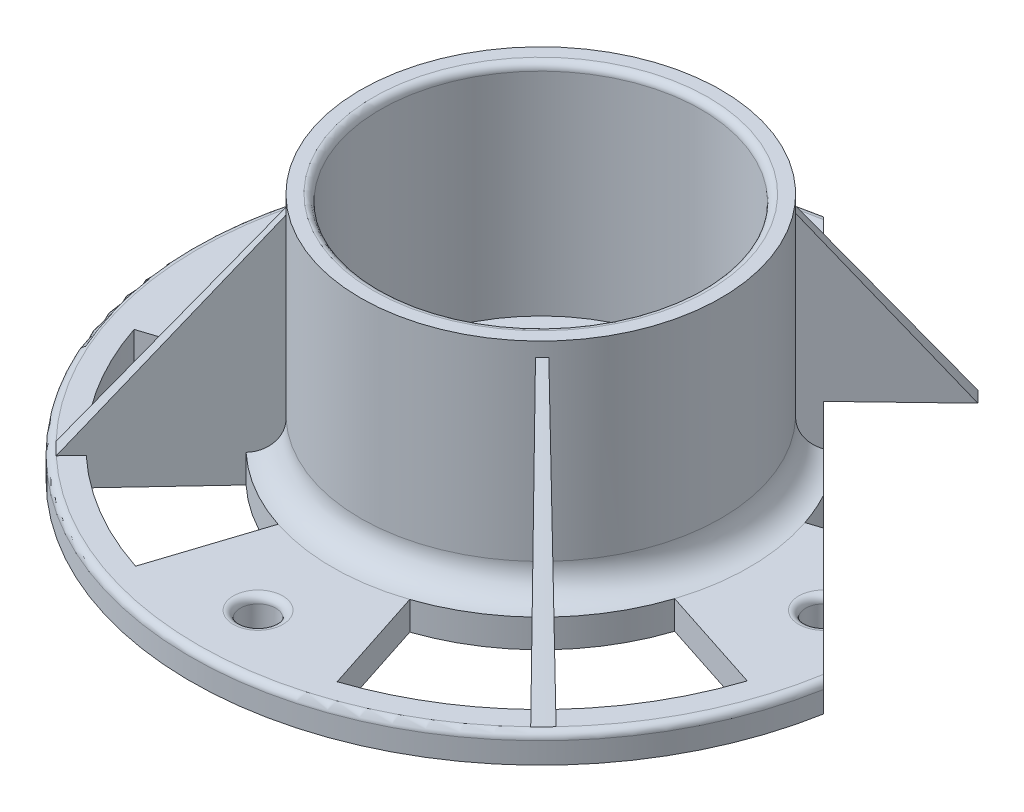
ISO-10303-21;
HEADER;
FILE_DESCRIPTION(('STEP AP214'),'2;1');
FILE_NAME('part.step','',(''),(''),'','','');
FILE_SCHEMA(('AUTOMOTIVE_DESIGN { 1 0 10303 214 1 1 1 1 }'));
ENDSEC;
DATA;
#1=APPLICATION_CONTEXT('core data for automotive mechanical design processes');
#2=APPLICATION_PROTOCOL_DEFINITION('international standard','automotive_design',2000,#1);
#3=PRODUCT_CONTEXT('',#1,'mechanical');
#4=PRODUCT('Part','Part','',(#3));
#5=PRODUCT_RELATED_PRODUCT_CATEGORY('part','',(#4));
#6=PRODUCT_DEFINITION_FORMATION('','',#4);
#7=PRODUCT_DEFINITION_CONTEXT('part definition',#1,'design');
#8=PRODUCT_DEFINITION('design','',#6,#7);
#9=PRODUCT_DEFINITION_SHAPE('','',#8);
#10=(LENGTH_UNIT() NAMED_UNIT(*) SI_UNIT(.MILLI.,.METRE.));
#11=(NAMED_UNIT(*) PLANE_ANGLE_UNIT() SI_UNIT($,.RADIAN.));
#12=(NAMED_UNIT(*) SI_UNIT($,.STERADIAN.) SOLID_ANGLE_UNIT());
#13=UNCERTAINTY_MEASURE_WITH_UNIT(LENGTH_MEASURE(1.E-05),#10,'distance_accuracy_value','');
#14=(GEOMETRIC_REPRESENTATION_CONTEXT(3) GLOBAL_UNCERTAINTY_ASSIGNED_CONTEXT((#13)) GLOBAL_UNIT_ASSIGNED_CONTEXT((#10,
#11,#12)) REPRESENTATION_CONTEXT('',''));
#15=CARTESIAN_POINT('',(0.,0.,0.));
#16=DIRECTION('',(0.,0.,1.));
#17=DIRECTION('',(1.,0.,0.));
#18=AXIS2_PLACEMENT_3D('',#15,#16,#17);
#19=CARTESIAN_POINT('',(0.,41.91,0.));
#20=DIRECTION('',(0.,-1.,0.));
#21=DIRECTION('',(0.,0.,-1.));
#22=AXIS2_PLACEMENT_3D('',#19,#20,#21);
#23=CONICAL_SURFACE('',#22,32.385,0.670521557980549);
#24=DIRECTION('',(0.448429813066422,-0.783497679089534,-0.430165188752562));
#25=VECTOR('',#24,1.);
#26=CARTESIAN_POINT('',(44.4500634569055,5.08,-42.6396046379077));
#27=LINE('',#26,#25);
#28=CARTESIAN_POINT('',(23.370651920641,41.91,-22.4187612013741));
#29=VERTEX_POINT('',#28);
#30=CARTESIAN_POINT('',(40.0888058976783,12.7,-38.4559818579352));
#31=VERTEX_POINT('',#30);
#32=EDGE_CURVE('E576',#29,#31,#27,.T.);
#33=ORIENTED_EDGE('',*,*,#32,.T.);
#34=CARTESIAN_POINT('',(0.,12.7,0.));
#35=DIRECTION('',(0.,-1.,0.));
#36=DIRECTION('',(0.,0.,-1.));
#37=AXIS2_PLACEMENT_3D('',#34,#35,#36);
#38=CIRCLE('',#37,55.5515517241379);
#39=CARTESIAN_POINT('',(38.0212349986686,12.7,-40.501365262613));
#40=VERTEX_POINT('',#39);
#41=EDGE_CURVE('E50',#31,#40,#38,.F.);
#42=ORIENTED_EDGE('',*,*,#41,.T.);
#43=DIRECTION('',(0.42530214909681,-0.783497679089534,-0.45304466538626));
#44=VECTOR('',#43,1.);
#45=CARTESIAN_POINT('',(42.1575617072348,5.08,-44.9075051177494));
#46=LINE('',#45,#44);
#47=CARTESIAN_POINT('',(22.1653159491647,41.91,-23.6111624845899));
#48=VERTEX_POINT('',#47);
#49=EDGE_CURVE('E396',#48,#40,#46,.T.);
#50=ORIENTED_EDGE('',*,*,#49,.F.);
#51=CARTESIAN_POINT('',(0.,41.91,0.));
#52=DIRECTION('',(0.,1.,0.));
#53=DIRECTION('',(0.,0.,1.));
#54=AXIS2_PLACEMENT_3D('',#51,#52,#53);
#55=CIRCLE('',#54,32.385);
#56=EDGE_CURVE('E579',#29,#48,#55,.T.);
#57=ORIENTED_EDGE('',*,*,#56,.F.);
#58=EDGE_LOOP('',(#33,#42,#50,#57));
#59=FACE_BOUND('',#58,.T.);
#60=ADVANCED_FACE('F42',(#59),#23,.T.);
#61=CARTESIAN_POINT('',(0.,5.08,0.));
#62=DIRECTION('',(0.,1.,0.));
#63=DIRECTION('',(0.,0.,1.));
#64=AXIS2_PLACEMENT_3D('',#61,#62,#63);
#65=PLANE('',#64);
#66=DIRECTION('',(0.707106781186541,0.,0.707106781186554));
#67=VECTOR('',#66,1.);
#68=CARTESIAN_POINT('',(25.4,5.08,-25.3999999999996));
#69=LINE('',#68,#67);
#70=CARTESIAN_POINT('',(38.0211706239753,5.08,-12.778829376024));
#71=VERTEX_POINT('',#70);
#72=CARTESIAN_POINT('',(47.6569103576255,5.08,-3.14308964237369));
#73=VERTEX_POINT('',#72);
#74=EDGE_CURVE('E835',#71,#73,#69,.T.);
#75=ORIENTED_EDGE('',*,*,#74,.F.);
#76=DIRECTION('',(0.951056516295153,0.,-0.309016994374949));
#77=VECTOR('',#76,1.);
#78=CARTESIAN_POINT('',(-0.124905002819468,5.08,-0.384418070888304));
#79=LINE('',#78,#77);
#80=CARTESIAN_POINT('',(35.5043536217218,5.08,-11.961065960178));
#81=VERTEX_POINT('',#80);
#82=EDGE_CURVE('E692',#81,#71,#79,.T.);
#83=ORIENTED_EDGE('',*,*,#82,.F.);
#84=CARTESIAN_POINT('',(0.,5.08,0.));
#85=DIRECTION('',(0.,1.,0.));
#86=DIRECTION('',(0.,0.,1.));
#87=AXIS2_PLACEMENT_3D('',#84,#85,#86);
#88=CIRCLE('',#87,37.465);
#89=CARTESIAN_POINT('',(35.6313323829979,5.08,11.5773216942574));
#90=VERTEX_POINT('',#89);
#91=EDGE_CURVE('E759',#81,#90,#88,.F.);
#92=ORIENTED_EDGE('',*,*,#91,.T.);
#93=DIRECTION('',(0.951056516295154,0.,0.309016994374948));
#94=VECTOR('',#93,1.);
#95=CARTESIAN_POINT('',(0.,5.08,0.));
#96=LINE('',#95,#94);
#97=CARTESIAN_POINT('',(54.9568007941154,5.08,17.8565470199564));
#98=VERTEX_POINT('',#97);
#99=EDGE_CURVE('E684',#90,#98,#96,.T.);
#100=ORIENTED_EDGE('',*,*,#99,.T.);
#101=CARTESIAN_POINT('',(0.,5.08,0.));
#102=DIRECTION('',(0.,1.,0.));
#103=DIRECTION('',(-1.,0.,0.));
#104=AXIS2_PLACEMENT_3D('',#101,#102,#103);
#105=CIRCLE('',#104,57.785);
#106=CARTESIAN_POINT('',(42.1297212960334,5.08,39.5498774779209));
#107=VERTEX_POINT('',#106);
#108=EDGE_CURVE('E680',#107,#98,#105,.T.);
#109=ORIENTED_EDGE('',*,*,#108,.F.);
#110=DIRECTION('',(0.729077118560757,0.,0.684431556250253));
#111=VECTOR('',#110,1.);
#112=CARTESIAN_POINT('',(0.,5.08,0.));
#113=LINE('',#112,#111);
#114=CARTESIAN_POINT('',(44.9075051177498,5.08,42.1575617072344));
#115=VERTEX_POINT('',#114);
#116=EDGE_CURVE('E482',#107,#115,#113,.T.);
#117=ORIENTED_EDGE('',*,*,#116,.T.);
#118=CARTESIAN_POINT('',(0.,5.08,0.));
#119=DIRECTION('',(0.,1.,0.));
#120=DIRECTION('',(0.,0.,1.));
#121=AXIS2_PLACEMENT_3D('',#118,#119,#120);
#122=CIRCLE('',#121,61.595);
#123=CARTESIAN_POINT('',(60.7809555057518,5.08,9.98095550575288));
#124=VERTEX_POINT('',#123);
#125=EDGE_CURVE('E757',#115,#124,#122,.T.);
#126=ORIENTED_EDGE('',*,*,#125,.T.);
#127=CARTESIAN_POINT('',(53.9430896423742,5.08,3.14308964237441));
#128=VERTEX_POINT('',#127);
#129=EDGE_CURVE('E440',#128,#124,#69,.T.);
#130=ORIENTED_EDGE('',*,*,#129,.F.);
#131=CARTESIAN_POINT('',(50.8,5.08,1.77367252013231E-13));
#132=DIRECTION('',(0.,1.,0.));
#133=DIRECTION('',(0.,0.,1.));
#134=AXIS2_PLACEMENT_3D('',#131,#132,#133);
#135=CIRCLE('',#134,4.445);
#136=EDGE_CURVE('E775',#128,#73,#135,.F.);
#137=ORIENTED_EDGE('',*,*,#136,.T.);
#138=EDGE_LOOP('',(#75,#83,#92,#100,#109,#117,#126,#130,#137));
#139=FACE_BOUND('',#138,.T.);
#140=ADVANCED_FACE('F935',(#139),#65,.T.);
#141=CARTESIAN_POINT('',(0.,10.16,0.));
#142=DIRECTION('',(0.,1.,0.));
#143=DIRECTION('',(0.,0.,1.));
#144=AXIS2_PLACEMENT_3D('',#141,#142,#143);
#145=TOROIDAL_SURFACE('',#144,37.465,5.08);
#146=CARTESIAN_POINT('',(32.926826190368,5.08,-17.8731738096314));
#147=VERTEX_POINT('',#146);
#148=EDGE_CURVE('E758',#147,#81,#88,.F.);
#149=ORIENTED_EDGE('',*,*,#148,.F.);
#150=CARTESIAN_POINT('',(37.4652,5.63179290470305,-13.3347999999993));
#151=CARTESIAN_POINT('',(37.3343356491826,5.59142837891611,-13.4656643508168));
#152=CARTESIAN_POINT('',(37.2030224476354,5.55406365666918,-13.5969775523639));
#153=CARTESIAN_POINT('',(36.9397002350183,5.48480817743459,-13.860299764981));
#154=CARTESIAN_POINT('',(36.8076913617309,5.45291637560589,-13.9923086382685));
#155=CARTESIAN_POINT('',(36.5432555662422,5.39409410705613,-14.2567444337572));
#156=CARTESIAN_POINT('',(36.4108291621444,5.36715894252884,-14.3891708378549));
#157=CARTESIAN_POINT('',(36.1455573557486,5.31774827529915,-14.6544426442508));
#158=CARTESIAN_POINT('',(36.0127119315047,5.29527301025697,-14.7872880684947));
#159=CARTESIAN_POINT('',(35.6147021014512,5.23403965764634,-15.1852978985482));
#160=CARTESIAN_POINT('',(35.3490735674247,5.20126075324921,-15.4509264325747));
#161=CARTESIAN_POINT('',(34.8171355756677,5.14870315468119,-15.9828644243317));
#162=CARTESIAN_POINT('',(34.5508259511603,5.12892802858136,-16.249174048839));
#163=CARTESIAN_POINT('',(34.0185859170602,5.09986810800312,-16.7814140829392));
#164=CARTESIAN_POINT('',(33.7526561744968,5.09055775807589,-17.0473438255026));
#165=CARTESIAN_POINT('',(33.2207512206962,5.08009859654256,-17.5792487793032));
#166=CARTESIAN_POINT('',(32.9547760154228,5.0789490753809,-17.8452239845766));
#167=CARTESIAN_POINT('',(32.4225769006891,5.08280137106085,-18.3774230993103));
#168=CARTESIAN_POINT('',(32.1563530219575,5.0878096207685,-18.6436469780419));
#169=CARTESIAN_POINT('',(31.6239627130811,5.10215756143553,-19.1760372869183));
#170=CARTESIAN_POINT('',(31.3577962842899,5.11149734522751,-19.4422037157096));
#171=CARTESIAN_POINT('',(30.8323867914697,5.13256293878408,-19.9676132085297));
#172=CARTESIAN_POINT('',(30.5731423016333,5.14422096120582,-20.2268576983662));
#173=CARTESIAN_POINT('',(30.0546794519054,5.16865691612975,-20.745320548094));
#174=CARTESIAN_POINT('',(29.7954610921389,5.18143485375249,-21.0045389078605));
#175=CARTESIAN_POINT('',(29.2771493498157,5.2068392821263,-21.5228506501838));
#176=CARTESIAN_POINT('',(29.0180559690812,5.21946584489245,-21.7819440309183));
#177=CARTESIAN_POINT('',(28.4998411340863,5.24346803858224,-22.3001588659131));
#178=CARTESIAN_POINT('',(28.2407196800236,5.2548436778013,-22.5592803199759));
#179=CARTESIAN_POINT('',(27.7219722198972,5.2754373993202,-23.0780277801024));
#180=CARTESIAN_POINT('',(27.4623461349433,5.28465161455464,-23.3376538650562));
#181=CARTESIAN_POINT('',(26.9430513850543,5.30017768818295,-23.8569486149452));
#182=CARTESIAN_POINT('',(26.6833827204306,5.30648956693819,-24.1166172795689));
#183=CARTESIAN_POINT('',(26.1638297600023,5.31573244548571,-24.6361702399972));
#184=CARTESIAN_POINT('',(25.9039454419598,5.31866104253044,-24.8960545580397));
#185=CARTESIAN_POINT('',(25.514109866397,5.32035072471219,-25.2858901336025));
#186=CARTESIAN_POINT('',(25.3841609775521,5.32046339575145,-25.4158390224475));
#187=CARTESIAN_POINT('',(25.1242642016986,5.31979149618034,-25.675735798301));
#188=CARTESIAN_POINT('',(24.9943163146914,5.31900692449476,-25.8056836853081));
#189=CARTESIAN_POINT('',(24.8643703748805,5.31777567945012,-25.9356296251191));
#190=B_SPLINE_CURVE_WITH_KNOTS('',3,(#150,#151,#152,#153,#154,#155,#156,#157,#158,#159,#160,
#161,#162,#163,#164,#165,#166,#167,#168,#169,#170,#171,#172,#173,#174,#175,#176,#177,#178,#179,
#180,#181,#182,#183,#184,#185,#186,#187,#188,#189),.UNSPECIFIED.,.F.,.F.,(4,2,2,2,2,2,2,2,2,2,2,
2,2,2,2,2,2,2,2,4),(0.,0.568209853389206,1.13631110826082,1.70387112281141,2.27146137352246,
3.40239464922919,4.53363810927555,5.66211297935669,6.79048973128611,7.9200462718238,
9.04962702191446,10.1500602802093,11.2504985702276,12.3503907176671,13.4502755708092,
14.5521135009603,15.6539437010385,16.7565559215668,17.3078805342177,17.8592058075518),.UNSPECIFIED.);
#191=CARTESIAN_POINT('',(25.9280265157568,5.31784708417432,-24.8719734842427));
#192=VERTEX_POINT('',#191);
#193=EDGE_CURVE('E426',#147,#192,#190,.T.);
#194=ORIENTED_EDGE('',*,*,#193,.T.);
#195=CARTESIAN_POINT('',(27.0366365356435,10.16,-25.9354296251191));
#196=DIRECTION('',(0.692257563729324,0.,0.721650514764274));
#197=DIRECTION('',(0.721650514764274,0.,-0.692257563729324));
#198=AXIS2_PLACEMENT_3D('',#195,#196,#197);
#199=CIRCLE('',#198,5.08);
#200=CARTESIAN_POINT('',(23.370651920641,10.16,-22.4187612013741));
#201=VERTEX_POINT('',#200);
#202=EDGE_CURVE('E583',#192,#201,#199,.F.);
#203=ORIENTED_EDGE('',*,*,#202,.T.);
#204=CARTESIAN_POINT('',(0.,10.16,0.));
#205=DIRECTION('',(0.,1.,0.));
#206=DIRECTION('',(0.,0.,1.));
#207=AXIS2_PLACEMENT_3D('',#204,#205,#206);
#208=CIRCLE('',#207,32.385);
#209=CARTESIAN_POINT('',(23.6111624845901,10.16,22.1653159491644));
#210=VERTEX_POINT('',#209);
#211=EDGE_CURVE('E748',#210,#201,#208,.T.);
#212=ORIENTED_EDGE('',*,*,#211,.F.);
#213=CARTESIAN_POINT('',(27.3148742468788,10.16,25.6422282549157));
#214=DIRECTION('',(-0.684431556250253,0.,0.729077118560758));
#215=DIRECTION('',(0.729077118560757,0.,0.684431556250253));
#216=AXIS2_PLACEMENT_3D('',#213,#214,#215);
#217=CIRCLE('',#216,5.08);
#218=CARTESIAN_POINT('',(27.3148742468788,5.08,25.6422282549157));
#219=VERTEX_POINT('',#218);
#220=EDGE_CURVE('E487',#219,#210,#217,.F.);
#221=ORIENTED_EDGE('',*,*,#220,.F.);
#222=CARTESIAN_POINT('',(0.,5.08,0.));
#223=DIRECTION('',(0.,1.,0.));
#224=DIRECTION('',(-1.,0.,0.));
#225=AXIS2_PLACEMENT_3D('',#222,#223,#224);
#226=CIRCLE('',#225,37.465);
#227=EDGE_CURVE('E666',#90,#219,#226,.F.);
#228=ORIENTED_EDGE('',*,*,#227,.F.);
#229=ORIENTED_EDGE('',*,*,#91,.F.);
#230=EDGE_LOOP('',(#149,#194,#203,#212,#221,#228,#229));
#231=FACE_BOUND('',#230,.T.);
#232=ADVANCED_FACE('F928',(#231),#145,.F.);
#233=CARTESIAN_POINT('',(0.,0.,0.));
#234=DIRECTION('',(0.,1.,0.));
#235=DIRECTION('',(0.,0.,1.));
#236=AXIS2_PLACEMENT_3D('',#233,#234,#235);
#237=CYLINDRICAL_SURFACE('',#236,37.465);
#238=DIRECTION('',(0.,1.,0.));
#239=VECTOR('',#238,1.);
#240=CARTESIAN_POINT('',(27.3148742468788,0.,25.6422282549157));
#241=LINE('',#240,#239);
#242=CARTESIAN_POINT('',(27.3148742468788,0.,25.6422282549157));
#243=VERTEX_POINT('',#242);
#244=EDGE_CURVE('E484',#243,#219,#241,.T.);
#245=ORIENTED_EDGE('',*,*,#244,.F.);
#246=CARTESIAN_POINT('',(0.,0.,0.));
#247=DIRECTION('',(0.,1.,0.));
#248=DIRECTION('',(-1.,0.,0.));
#249=AXIS2_PLACEMENT_3D('',#246,#247,#248);
#250=CIRCLE('',#249,37.465);
#251=CARTESIAN_POINT('',(35.6313323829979,0.,11.5773216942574));
#252=VERTEX_POINT('',#251);
#253=EDGE_CURVE('E674',#252,#243,#250,.F.);
#254=ORIENTED_EDGE('',*,*,#253,.F.);
#255=DIRECTION('',(0.,1.,0.));
#256=VECTOR('',#255,1.);
#257=CARTESIAN_POINT('',(35.6313323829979,0.,11.5773216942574));
#258=LINE('',#257,#256);
#259=EDGE_CURVE('E693',#252,#90,#258,.T.);
#260=ORIENTED_EDGE('',*,*,#259,.T.);
#261=ORIENTED_EDGE('',*,*,#227,.T.);
#262=EDGE_LOOP('',(#245,#254,#260,#261));
#263=FACE_BOUND('',#262,.T.);
#264=ADVANCED_FACE('F1058',(#263),#237,.T.);
#265=CARTESIAN_POINT('',(0.,0.,0.));
#266=DIRECTION('',(0.,1.,0.));
#267=DIRECTION('',(0.,0.,1.));
#268=AXIS2_PLACEMENT_3D('',#265,#266,#267);
#269=CYLINDRICAL_SURFACE('',#268,57.785);
#270=DIRECTION('',(0.,1.,0.));
#271=VECTOR('',#270,1.);
#272=CARTESIAN_POINT('',(42.1297212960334,0.,39.5498774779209));
#273=LINE('',#272,#271);
#274=CARTESIAN_POINT('',(42.1297212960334,0.,39.5498774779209));
#275=VERTEX_POINT('',#274);
#276=EDGE_CURVE('E806',#107,#275,#273,.F.);
#277=ORIENTED_EDGE('',*,*,#276,.F.);
#278=ORIENTED_EDGE('',*,*,#108,.T.);
#279=DIRECTION('',(0.,1.,0.));
#280=VECTOR('',#279,1.);
#281=CARTESIAN_POINT('',(54.9568007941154,0.,17.8565470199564));
#282=LINE('',#281,#280);
#283=CARTESIAN_POINT('',(54.9568007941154,0.,17.8565470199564));
#284=VERTEX_POINT('',#283);
#285=EDGE_CURVE('E696',#284,#98,#282,.T.);
#286=ORIENTED_EDGE('',*,*,#285,.F.);
#287=CARTESIAN_POINT('',(0.,0.,0.));
#288=DIRECTION('',(0.,1.,0.));
#289=DIRECTION('',(-1.,0.,0.));
#290=AXIS2_PLACEMENT_3D('',#287,#288,#289);
#291=CIRCLE('',#290,57.785);
#292=EDGE_CURVE('E665',#275,#284,#291,.T.);
#293=ORIENTED_EDGE('',*,*,#292,.F.);
#294=EDGE_LOOP('',(#277,#278,#286,#293));
#295=FACE_BOUND('',#294,.T.);
#296=ADVANCED_FACE('F1065',(#295),#269,.F.);
#297=DIRECTION('',(0.692257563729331,0.,0.721650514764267));
#298=VECTOR('',#297,1.);
#299=CARTESIAN_POINT('',(0.,5.08,0.));
#300=LINE('',#299,#298);
#301=CARTESIAN_POINT('',(40.0021033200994,5.08,41.7005749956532));
#302=VERTEX_POINT('',#301);
#303=CARTESIAN_POINT('',(42.6396046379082,5.08,44.450063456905));
#304=VERTEX_POINT('',#303);
#305=EDGE_CURVE('E490',#302,#304,#300,.T.);
#306=ORIENTED_EDGE('',*,*,#305,.F.);
#307=CARTESIAN_POINT('',(18.240528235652,5.08,54.8305512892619));
#308=VERTEX_POINT('',#307);
#309=EDGE_CURVE('E681',#308,#302,#105,.T.);
#310=ORIENTED_EDGE('',*,*,#309,.F.);
#311=DIRECTION('',(0.309016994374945,0.,0.951056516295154));
#312=VECTOR('',#311,1.);
#313=CARTESIAN_POINT('',(0.384418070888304,5.08,-0.124905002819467));
#314=LINE('',#313,#312);
#315=CARTESIAN_POINT('',(11.9610659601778,5.08,35.5043536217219));
#316=VERTEX_POINT('',#315);
#317=EDGE_CURVE('E654',#316,#308,#314,.T.);
#318=ORIENTED_EDGE('',*,*,#317,.F.);
#319=CARTESIAN_POINT('',(-11.5773216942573,5.08,35.631332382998));
#320=VERTEX_POINT('',#319);
#321=EDGE_CURVE('E937',#316,#320,#88,.F.);
#322=ORIENTED_EDGE('',*,*,#321,.T.);
#323=DIRECTION('',(-0.309016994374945,0.,0.951056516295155));
#324=VECTOR('',#323,1.);
#325=CARTESIAN_POINT('',(0.,5.08,0.));
#326=LINE('',#325,#324);
#327=CARTESIAN_POINT('',(-17.8565470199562,5.08,54.9568007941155));
#328=VERTEX_POINT('',#327);
#329=EDGE_CURVE('E646',#320,#328,#326,.T.);
#330=ORIENTED_EDGE('',*,*,#329,.T.);
#331=CARTESIAN_POINT('',(0.,5.08,0.));
#332=DIRECTION('',(0.,1.,0.));
#333=DIRECTION('',(0.,0.,-1.));
#334=AXIS2_PLACEMENT_3D('',#331,#332,#333);
#335=CIRCLE('',#334,57.785);
#336=CARTESIAN_POINT('',(-39.5498774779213,5.08,42.129721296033));
#337=VERTEX_POINT('',#336);
#338=EDGE_CURVE('E642',#337,#328,#335,.T.);
#339=ORIENTED_EDGE('',*,*,#338,.F.);
#340=DIRECTION('',(-0.684431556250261,0.,0.72907711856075));
#341=VECTOR('',#340,1.);
#342=CARTESIAN_POINT('',(0.,5.08,0.));
#343=LINE('',#342,#341);
#344=CARTESIAN_POINT('',(-42.1575617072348,5.08,44.9075051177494));
#345=VERTEX_POINT('',#344);
#346=EDGE_CURVE('E519',#337,#345,#343,.T.);
#347=ORIENTED_EDGE('',*,*,#346,.T.);
#348=EDGE_CURVE('E1186',#345,#304,#122,.T.);
#349=ORIENTED_EDGE('',*,*,#348,.T.);
#350=EDGE_LOOP('',(#306,#310,#318,#322,#330,#339,#347,#349));
#351=FACE_BOUND('',#350,.T.);
#352=CARTESIAN_POINT('',(0.,5.08,50.8));
#353=DIRECTION('',(0.,1.,0.));
#354=DIRECTION('',(0.,0.,1.));
#355=AXIS2_PLACEMENT_3D('',#352,#353,#354);
#356=CIRCLE('',#355,4.445);
#357=CARTESIAN_POINT('',(0.,5.08,55.245));
#358=VERTEX_POINT('',#357);
#359=EDGE_CURVE('E781',#358,#358,#356,.F.);
#360=ORIENTED_EDGE('',*,*,#359,.T.);
#361=EDGE_LOOP('',(#360));
#362=FACE_BOUND('',#361,.T.);
#363=ADVANCED_FACE('F1016',(#351,#362),#65,.T.);
#364=CARTESIAN_POINT('',(25.9354296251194,5.08,27.0366365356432));
#365=VERTEX_POINT('',#364);
#366=EDGE_CURVE('E687',#365,#316,#226,.F.);
#367=ORIENTED_EDGE('',*,*,#366,.F.);
#368=CARTESIAN_POINT('',(25.9354296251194,10.16,27.0366365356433));
#369=DIRECTION('',(-0.721650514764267,0.,0.692257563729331));
#370=DIRECTION('',(0.692257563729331,0.,0.721650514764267));
#371=AXIS2_PLACEMENT_3D('',#368,#369,#370);
#372=CIRCLE('',#371,5.08);
#373=CARTESIAN_POINT('',(22.4187612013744,10.16,23.3706519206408));
#374=VERTEX_POINT('',#373);
#375=EDGE_CURVE('E495',#365,#374,#372,.F.);
#376=ORIENTED_EDGE('',*,*,#375,.T.);
#377=CARTESIAN_POINT('',(-22.1653159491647,10.16,23.6111624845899));
#378=VERTEX_POINT('',#377);
#379=EDGE_CURVE('E886',#378,#374,#208,.T.);
#380=ORIENTED_EDGE('',*,*,#379,.F.);
#381=CARTESIAN_POINT('',(-25.642228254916,10.16,27.3148742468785));
#382=DIRECTION('',(-0.72907711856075,0.,-0.684431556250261));
#383=DIRECTION('',(-0.684431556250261,0.,0.72907711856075));
#384=AXIS2_PLACEMENT_3D('',#381,#382,#383);
#385=CIRCLE('',#384,5.08);
#386=CARTESIAN_POINT('',(-25.642228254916,5.08,27.3148742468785));
#387=VERTEX_POINT('',#386);
#388=EDGE_CURVE('E524',#387,#378,#385,.F.);
#389=ORIENTED_EDGE('',*,*,#388,.F.);
#390=CARTESIAN_POINT('',(0.,5.08,0.));
#391=DIRECTION('',(0.,1.,0.));
#392=DIRECTION('',(0.,0.,-1.));
#393=AXIS2_PLACEMENT_3D('',#390,#391,#392);
#394=CIRCLE('',#393,37.465);
#395=EDGE_CURVE('E628',#320,#387,#394,.F.);
#396=ORIENTED_EDGE('',*,*,#395,.F.);
#397=ORIENTED_EDGE('',*,*,#321,.F.);
#398=EDGE_LOOP('',(#367,#376,#380,#389,#396,#397));
#399=FACE_BOUND('',#398,.T.);
#400=ADVANCED_FACE('F911',(#399),#145,.F.);
#401=CARTESIAN_POINT('',(0.,0.,0.));
#402=DIRECTION('',(0.,1.,0.));
#403=DIRECTION('',(0.,0.,1.));
#404=AXIS2_PLACEMENT_3D('',#401,#402,#403);
#405=CYLINDRICAL_SURFACE('',#404,37.465);
#406=DIRECTION('',(0.,1.,0.));
#407=VECTOR('',#406,1.);
#408=CARTESIAN_POINT('',(-25.642228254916,0.,27.3148742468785));
#409=LINE('',#408,#407);
#410=CARTESIAN_POINT('',(-25.642228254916,0.,27.3148742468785));
#411=VERTEX_POINT('',#410);
#412=EDGE_CURVE('E521',#411,#387,#409,.T.);
#413=ORIENTED_EDGE('',*,*,#412,.F.);
#414=CARTESIAN_POINT('',(0.,0.,0.));
#415=DIRECTION('',(0.,1.,0.));
#416=DIRECTION('',(0.,0.,-1.));
#417=AXIS2_PLACEMENT_3D('',#414,#415,#416);
#418=CIRCLE('',#417,37.465);
#419=CARTESIAN_POINT('',(-11.5773216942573,0.,35.631332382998));
#420=VERTEX_POINT('',#419);
#421=EDGE_CURVE('E636',#420,#411,#418,.F.);
#422=ORIENTED_EDGE('',*,*,#421,.F.);
#423=DIRECTION('',(0.,1.,0.));
#424=VECTOR('',#423,1.);
#425=CARTESIAN_POINT('',(-11.5773216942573,0.,35.631332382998));
#426=LINE('',#425,#424);
#427=EDGE_CURVE('E655',#420,#320,#426,.T.);
#428=ORIENTED_EDGE('',*,*,#427,.T.);
#429=ORIENTED_EDGE('',*,*,#395,.T.);
#430=EDGE_LOOP('',(#413,#422,#428,#429));
#431=FACE_BOUND('',#430,.T.);
#432=ADVANCED_FACE('F1040',(#431),#405,.T.);
#433=CARTESIAN_POINT('',(0.,0.,0.));
#434=DIRECTION('',(0.,1.,0.));
#435=DIRECTION('',(0.,0.,1.));
#436=AXIS2_PLACEMENT_3D('',#433,#434,#435);
#437=CYLINDRICAL_SURFACE('',#436,57.785);
#438=DIRECTION('',(0.,1.,0.));
#439=VECTOR('',#438,1.);
#440=CARTESIAN_POINT('',(-39.5498774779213,0.,42.129721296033));
#441=LINE('',#440,#439);
#442=CARTESIAN_POINT('',(-39.5498774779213,0.,42.129721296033));
#443=VERTEX_POINT('',#442);
#444=EDGE_CURVE('E801',#337,#443,#441,.F.);
#445=ORIENTED_EDGE('',*,*,#444,.F.);
#446=ORIENTED_EDGE('',*,*,#338,.T.);
#447=DIRECTION('',(0.,1.,0.));
#448=VECTOR('',#447,1.);
#449=CARTESIAN_POINT('',(-17.8565470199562,0.,54.9568007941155));
#450=LINE('',#449,#448);
#451=CARTESIAN_POINT('',(-17.8565470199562,0.,54.9568007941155));
#452=VERTEX_POINT('',#451);
#453=EDGE_CURVE('E658',#452,#328,#450,.T.);
#454=ORIENTED_EDGE('',*,*,#453,.F.);
#455=CARTESIAN_POINT('',(0.,0.,0.));
#456=DIRECTION('',(0.,1.,0.));
#457=DIRECTION('',(0.,0.,-1.));
#458=AXIS2_PLACEMENT_3D('',#455,#456,#457);
#459=CIRCLE('',#458,57.785);
#460=EDGE_CURVE('E627',#443,#452,#459,.T.);
#461=ORIENTED_EDGE('',*,*,#460,.F.);
#462=EDGE_LOOP('',(#445,#446,#454,#461));
#463=FACE_BOUND('',#462,.T.);
#464=ADVANCED_FACE('F1047',(#463),#437,.F.);
#465=DIRECTION('',(-0.721650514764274,0.,0.692257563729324));
#466=VECTOR('',#465,1.);
#467=CARTESIAN_POINT('',(0.,5.08,0.));
#468=LINE('',#467,#466);
#469=CARTESIAN_POINT('',(-41.7005749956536,5.08,40.002103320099));
#470=VERTEX_POINT('',#469);
#471=CARTESIAN_POINT('',(-44.4500634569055,5.08,42.6396046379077));
#472=VERTEX_POINT('',#471);
#473=EDGE_CURVE('E527',#470,#472,#468,.T.);
#474=ORIENTED_EDGE('',*,*,#473,.F.);
#475=CARTESIAN_POINT('',(-54.8305512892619,5.08,18.2405282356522));
#476=VERTEX_POINT('',#475);
#477=EDGE_CURVE('E643',#476,#470,#335,.T.);
#478=ORIENTED_EDGE('',*,*,#477,.F.);
#479=DIRECTION('',(-0.951056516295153,0.,0.309016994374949));
#480=VECTOR('',#479,1.);
#481=CARTESIAN_POINT('',(0.124905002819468,5.08,0.384418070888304));
#482=LINE('',#481,#480);
#483=CARTESIAN_POINT('',(-35.5043536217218,5.08,11.961065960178));
#484=VERTEX_POINT('',#483);
#485=EDGE_CURVE('E616',#484,#476,#482,.T.);
#486=ORIENTED_EDGE('',*,*,#485,.F.);
#487=CARTESIAN_POINT('',(-35.6313323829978,5.08,-11.5773216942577));
#488=VERTEX_POINT('',#487);
#489=EDGE_CURVE('E938',#484,#488,#88,.F.);
#490=ORIENTED_EDGE('',*,*,#489,.T.);
#491=DIRECTION('',(-0.951056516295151,0.,-0.309016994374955));
#492=VECTOR('',#491,1.);
#493=CARTESIAN_POINT('',(0.,5.08,0.));
#494=LINE('',#493,#492);
#495=CARTESIAN_POINT('',(-54.9568007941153,5.08,-17.8565470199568));
#496=VERTEX_POINT('',#495);
#497=EDGE_CURVE('E608',#488,#496,#494,.T.);
#498=ORIENTED_EDGE('',*,*,#497,.T.);
#499=CARTESIAN_POINT('',(0.,5.08,0.));
#500=DIRECTION('',(0.,1.,0.));
#501=DIRECTION('',(1.,0.,0.));
#502=AXIS2_PLACEMENT_3D('',#499,#500,#501);
#503=CIRCLE('',#502,57.785);
#504=CARTESIAN_POINT('',(-42.1297212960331,5.08,-39.5498774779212));
#505=VERTEX_POINT('',#504);
#506=EDGE_CURVE('E604',#505,#496,#503,.T.);
#507=ORIENTED_EDGE('',*,*,#506,.F.);
#508=DIRECTION('',(-0.729077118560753,0.,-0.684431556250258));
#509=VECTOR('',#508,1.);
#510=CARTESIAN_POINT('',(0.,5.08,0.));
#511=LINE('',#510,#509);
#512=CARTESIAN_POINT('',(-44.9075051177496,5.08,-42.1575617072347));
#513=VERTEX_POINT('',#512);
#514=EDGE_CURVE('E556',#505,#513,#511,.T.);
#515=ORIENTED_EDGE('',*,*,#514,.T.);
#516=EDGE_CURVE('E763',#513,#472,#122,.T.);
#517=ORIENTED_EDGE('',*,*,#516,.T.);
#518=EDGE_LOOP('',(#474,#478,#486,#490,#498,#507,#515,#517));
#519=FACE_BOUND('',#518,.T.);
#520=CARTESIAN_POINT('',(-50.8,5.08,-5.32101756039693E-13));
#521=DIRECTION('',(0.,1.,0.));
#522=DIRECTION('',(0.,0.,1.));
#523=AXIS2_PLACEMENT_3D('',#520,#521,#522);
#524=CIRCLE('',#523,4.445);
#525=CARTESIAN_POINT('',(-50.8,5.08,4.44499999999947));
#526=VERTEX_POINT('',#525);
#527=EDGE_CURVE('E787',#526,#526,#524,.F.);
#528=ORIENTED_EDGE('',*,*,#527,.T.);
#529=EDGE_LOOP('',(#528));
#530=FACE_BOUND('',#529,.T.);
#531=ADVANCED_FACE('F978',(#519,#530),#65,.T.);
#532=CARTESIAN_POINT('',(-27.0366365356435,5.08,25.9354296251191));
#533=VERTEX_POINT('',#532);
#534=EDGE_CURVE('E649',#533,#484,#394,.F.);
#535=ORIENTED_EDGE('',*,*,#534,.F.);
#536=CARTESIAN_POINT('',(-27.0366365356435,10.16,25.9354296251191));
#537=DIRECTION('',(-0.692257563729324,0.,-0.721650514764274));
#538=DIRECTION('',(-0.721650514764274,0.,0.692257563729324));
#539=AXIS2_PLACEMENT_3D('',#536,#537,#538);
#540=CIRCLE('',#539,5.08);
#541=CARTESIAN_POINT('',(-23.370651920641,10.16,22.4187612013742));
#542=VERTEX_POINT('',#541);
#543=EDGE_CURVE('E532',#533,#542,#540,.F.);
#544=ORIENTED_EDGE('',*,*,#543,.T.);
#545=CARTESIAN_POINT('',(-23.61116248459,10.16,-22.1653159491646));
#546=VERTEX_POINT('',#545);
#547=EDGE_CURVE('E753',#546,#542,#208,.T.);
#548=ORIENTED_EDGE('',*,*,#547,.F.);
#549=CARTESIAN_POINT('',(-27.3148742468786,10.16,-25.6422282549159));
#550=DIRECTION('',(0.684431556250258,0.,-0.729077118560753));
#551=DIRECTION('',(-0.729077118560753,0.,-0.684431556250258));
#552=AXIS2_PLACEMENT_3D('',#549,#550,#551);
#553=CIRCLE('',#552,5.08);
#554=CARTESIAN_POINT('',(-27.3148742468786,5.08,-25.6422282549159));
#555=VERTEX_POINT('',#554);
#556=EDGE_CURVE('E561',#555,#546,#553,.F.);
#557=ORIENTED_EDGE('',*,*,#556,.F.);
#558=CARTESIAN_POINT('',(0.,5.08,0.));
#559=DIRECTION('',(0.,1.,0.));
#560=DIRECTION('',(1.,0.,0.));
#561=AXIS2_PLACEMENT_3D('',#558,#559,#560);
#562=CIRCLE('',#561,37.465);
#563=EDGE_CURVE('E590',#488,#555,#562,.F.);
#564=ORIENTED_EDGE('',*,*,#563,.F.);
#565=ORIENTED_EDGE('',*,*,#489,.F.);
#566=EDGE_LOOP('',(#535,#544,#548,#557,#564,#565));
#567=FACE_BOUND('',#566,.T.);
#568=ADVANCED_FACE('F969',(#567),#145,.F.);
#569=CARTESIAN_POINT('',(0.,0.,0.));
#570=DIRECTION('',(0.,1.,0.));
#571=DIRECTION('',(0.,0.,1.));
#572=AXIS2_PLACEMENT_3D('',#569,#570,#571);
#573=CYLINDRICAL_SURFACE('',#572,37.465);
#574=DIRECTION('',(0.,1.,0.));
#575=VECTOR('',#574,1.);
#576=CARTESIAN_POINT('',(-27.3148742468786,0.,-25.6422282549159));
#577=LINE('',#576,#575);
#578=CARTESIAN_POINT('',(-27.3148742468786,0.,-25.6422282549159));
#579=VERTEX_POINT('',#578);
#580=EDGE_CURVE('E558',#579,#555,#577,.T.);
#581=ORIENTED_EDGE('',*,*,#580,.F.);
#582=CARTESIAN_POINT('',(0.,0.,0.));
#583=DIRECTION('',(0.,1.,0.));
#584=DIRECTION('',(1.,0.,0.));
#585=AXIS2_PLACEMENT_3D('',#582,#583,#584);
#586=CIRCLE('',#585,37.465);
#587=CARTESIAN_POINT('',(-35.6313323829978,0.,-11.5773216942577));
#588=VERTEX_POINT('',#587);
#589=EDGE_CURVE('E598',#588,#579,#586,.F.);
#590=ORIENTED_EDGE('',*,*,#589,.F.);
#591=DIRECTION('',(0.,1.,0.));
#592=VECTOR('',#591,1.);
#593=CARTESIAN_POINT('',(-35.6313323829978,0.,-11.5773216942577));
#594=LINE('',#593,#592);
#595=EDGE_CURVE('E617',#588,#488,#594,.T.);
#596=ORIENTED_EDGE('',*,*,#595,.T.);
#597=ORIENTED_EDGE('',*,*,#563,.T.);
#598=EDGE_LOOP('',(#581,#590,#596,#597));
#599=FACE_BOUND('',#598,.T.);
#600=ADVANCED_FACE('F971',(#599),#573,.T.);
#601=CARTESIAN_POINT('',(0.,0.,0.));
#602=DIRECTION('',(0.,1.,0.));
#603=DIRECTION('',(0.,0.,1.));
#604=AXIS2_PLACEMENT_3D('',#601,#602,#603);
#605=CYLINDRICAL_SURFACE('',#604,57.785);
#606=DIRECTION('',(0.,1.,0.));
#607=VECTOR('',#606,1.);
#608=CARTESIAN_POINT('',(-42.1297212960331,0.,-39.5498774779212));
#609=LINE('',#608,#607);
#610=CARTESIAN_POINT('',(-42.1297212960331,0.,-39.5498774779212));
#611=VERTEX_POINT('',#610);
#612=EDGE_CURVE('E796',#505,#611,#609,.F.);
#613=ORIENTED_EDGE('',*,*,#612,.F.);
#614=ORIENTED_EDGE('',*,*,#506,.T.);
#615=DIRECTION('',(0.,1.,0.));
#616=VECTOR('',#615,1.);
#617=CARTESIAN_POINT('',(-54.9568007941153,0.,-17.8565470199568));
#618=LINE('',#617,#616);
#619=CARTESIAN_POINT('',(-54.9568007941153,0.,-17.8565470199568));
#620=VERTEX_POINT('',#619);
#621=EDGE_CURVE('E620',#620,#496,#618,.T.);
#622=ORIENTED_EDGE('',*,*,#621,.F.);
#623=CARTESIAN_POINT('',(0.,0.,0.));
#624=DIRECTION('',(0.,1.,0.));
#625=DIRECTION('',(1.,0.,0.));
#626=AXIS2_PLACEMENT_3D('',#623,#624,#625);
#627=CIRCLE('',#626,57.785);
#628=EDGE_CURVE('E589',#611,#620,#627,.T.);
#629=ORIENTED_EDGE('',*,*,#628,.F.);
#630=EDGE_LOOP('',(#613,#614,#622,#629));
#631=FACE_BOUND('',#630,.T.);
#632=ADVANCED_FACE('F983',(#631),#605,.F.);
#633=CARTESIAN_POINT('',(0.,0.,0.));
#634=DIRECTION('',(0.,1.,0.));
#635=DIRECTION('',(0.,0.,1.));
#636=AXIS2_PLACEMENT_3D('',#633,#634,#635);
#637=CYLINDRICAL_SURFACE('',#636,37.465);
#638=CARTESIAN_POINT('',(11.5773216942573,5.08,-35.631332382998));
#639=VERTEX_POINT('',#638);
#640=CARTESIAN_POINT('',(17.8731738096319,5.08,-32.9268261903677));
#641=VERTEX_POINT('',#640);
#642=EDGE_CURVE('E754',#639,#641,#88,.F.);
#643=ORIENTED_EDGE('',*,*,#642,.T.);
#644=DIRECTION('',(0.,1.,0.));
#645=VECTOR('',#644,1.);
#646=CARTESIAN_POINT('',(17.873173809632,0.,-32.9268261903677));
#647=LINE('',#646,#645);
#648=CARTESIAN_POINT('',(17.873173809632,0.,-32.9268261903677));
#649=VERTEX_POINT('',#648);
#650=EDGE_CURVE('E406',#641,#649,#647,.F.);
#651=ORIENTED_EDGE('',*,*,#650,.T.);
#652=CARTESIAN_POINT('',(0.,0.,0.));
#653=DIRECTION('',(0.,1.,0.));
#654=DIRECTION('',(0.,0.,1.));
#655=AXIS2_PLACEMENT_3D('',#652,#653,#654);
#656=CIRCLE('',#655,37.465);
#657=CARTESIAN_POINT('',(11.5773216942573,0.,-35.631332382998));
#658=VERTEX_POINT('',#657);
#659=EDGE_CURVE('E708',#658,#649,#656,.F.);
#660=ORIENTED_EDGE('',*,*,#659,.F.);
#661=DIRECTION('',(0.,1.,0.));
#662=VECTOR('',#661,1.);
#663=CARTESIAN_POINT('',(11.5773216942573,0.,-35.631332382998));
#664=LINE('',#663,#662);
#665=EDGE_CURVE('E711',#658,#639,#664,.T.);
#666=ORIENTED_EDGE('',*,*,#665,.T.);
#667=EDGE_LOOP('',(#643,#651,#660,#666));
#668=FACE_BOUND('',#667,.T.);
#669=ADVANCED_FACE('F872',(#668),#637,.T.);
#670=CARTESIAN_POINT('',(0.,5.08,0.));
#671=DIRECTION('',(0.,-1.,0.));
#672=DIRECTION('',(0.,0.,-1.));
#673=AXIS2_PLACEMENT_3D('',#670,#671,#672);
#674=CYLINDRICAL_SURFACE('',#673,62.865);
#675=CARTESIAN_POINT('',(0.,3.81,0.));
#676=DIRECTION('',(0.,1.,0.));
#677=DIRECTION('',(0.,0.,1.));
#678=AXIS2_PLACEMENT_3D('',#675,#676,#677);
#679=CIRCLE('',#678,62.865);
#680=CARTESIAN_POINT('',(61.8807361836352,3.81,11.0807361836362));
#681=VERTEX_POINT('',#680);
#682=CARTESIAN_POINT('',(-11.0807361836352,3.81,-61.8807361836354));
#683=VERTEX_POINT('',#682);
#684=EDGE_CURVE('E762',#681,#683,#679,.F.);
#685=ORIENTED_EDGE('',*,*,#684,.T.);
#686=DIRECTION('',(0.,-1.,0.));
#687=VECTOR('',#686,1.);
#688=CARTESIAN_POINT('',(-11.0807361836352,5.08,-61.8807361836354));
#689=LINE('',#688,#687);
#690=CARTESIAN_POINT('',(-11.0807361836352,0.,-61.8807361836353));
#691=VERTEX_POINT('',#690);
#692=EDGE_CURVE('E460',#683,#691,#689,.T.);
#693=ORIENTED_EDGE('',*,*,#692,.T.);
#694=CARTESIAN_POINT('',(0.,0.,0.));
#695=DIRECTION('',(0.,1.,0.));
#696=DIRECTION('',(0.,0.,1.));
#697=AXIS2_PLACEMENT_3D('',#694,#695,#696);
#698=CIRCLE('',#697,62.865);
#699=CARTESIAN_POINT('',(61.8807361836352,0.,11.0807361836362));
#700=VERTEX_POINT('',#699);
#701=EDGE_CURVE('E745',#691,#700,#698,.T.);
#702=ORIENTED_EDGE('',*,*,#701,.T.);
#703=DIRECTION('',(0.,-1.,0.));
#704=VECTOR('',#703,1.);
#705=CARTESIAN_POINT('',(61.8807361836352,5.08,11.0807361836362));
#706=LINE('',#705,#704);
#707=EDGE_CURVE('E441',#700,#681,#706,.F.);
#708=ORIENTED_EDGE('',*,*,#707,.T.);
#709=EDGE_LOOP('',(#685,#693,#702,#708));
#710=FACE_BOUND('',#709,.T.);
#711=ADVANCED_FACE('F1111',(#710),#674,.T.);
#712=DIRECTION('',(0.707106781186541,0.,0.707106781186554));
#713=VECTOR('',#712,1.);
#714=CARTESIAN_POINT('',(25.4,5.08,-25.3999999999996));
#715=LINE('',#714,#713);
#716=CARTESIAN_POINT('',(-9.98095550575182,5.08,-60.780955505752));
#717=VERTEX_POINT('',#716);
#718=CARTESIAN_POINT('',(-3.14308964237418,5.08,-53.9430896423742));
#719=VERTEX_POINT('',#718);
#720=EDGE_CURVE('E57',#717,#719,#715,.T.);
#721=ORIENTED_EDGE('',*,*,#720,.F.);
#722=CARTESIAN_POINT('',(-42.6396046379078,5.08,-44.4500634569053));
#723=VERTEX_POINT('',#722);
#724=EDGE_CURVE('E760',#717,#723,#122,.T.);
#725=ORIENTED_EDGE('',*,*,#724,.T.);
#726=DIRECTION('',(-0.692257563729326,0.,-0.721650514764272));
#727=VECTOR('',#726,1.);
#728=CARTESIAN_POINT('',(0.,5.08,0.));
#729=LINE('',#728,#727);
#730=CARTESIAN_POINT('',(-40.0021033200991,5.08,-41.7005749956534));
#731=VERTEX_POINT('',#730);
#732=EDGE_CURVE('E564',#731,#723,#729,.T.);
#733=ORIENTED_EDGE('',*,*,#732,.F.);
#734=CARTESIAN_POINT('',(-18.2405282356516,5.08,-54.830551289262));
#735=VERTEX_POINT('',#734);
#736=EDGE_CURVE('E605',#735,#731,#503,.T.);
#737=ORIENTED_EDGE('',*,*,#736,.F.);
#738=DIRECTION('',(-0.309016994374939,0.,-0.951056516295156));
#739=VECTOR('',#738,1.);
#740=CARTESIAN_POINT('',(-0.384418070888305,5.08,0.124905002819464));
#741=LINE('',#740,#739);
#742=CARTESIAN_POINT('',(-11.9610659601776,5.08,-35.5043536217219));
#743=VERTEX_POINT('',#742);
#744=EDGE_CURVE('E585',#743,#735,#741,.T.);
#745=ORIENTED_EDGE('',*,*,#744,.F.);
#746=EDGE_CURVE('E752',#743,#639,#88,.F.);
#747=ORIENTED_EDGE('',*,*,#746,.T.);
#748=DIRECTION('',(0.309016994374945,0.,-0.951056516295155));
#749=VECTOR('',#748,1.);
#750=CARTESIAN_POINT('',(0.,5.08,0.));
#751=LINE('',#750,#749);
#752=CARTESIAN_POINT('',(12.4580535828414,5.08,-38.3419464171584));
#753=VERTEX_POINT('',#752);
#754=EDGE_CURVE('E704',#639,#753,#751,.T.);
#755=ORIENTED_EDGE('',*,*,#754,.T.);
#756=CARTESIAN_POINT('',(3.14308964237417,5.08,-47.6569103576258));
#757=VERTEX_POINT('',#756);
#758=EDGE_CURVE('E824',#757,#753,#715,.T.);
#759=ORIENTED_EDGE('',*,*,#758,.F.);
#760=CARTESIAN_POINT('',(0.,5.08,-50.8));
#761=DIRECTION('',(0.,1.,0.));
#762=DIRECTION('',(0.,0.,1.));
#763=AXIS2_PLACEMENT_3D('',#760,#761,#762);
#764=CIRCLE('',#763,4.445);
#765=EDGE_CURVE('E769',#757,#719,#764,.F.);
#766=ORIENTED_EDGE('',*,*,#765,.T.);
#767=EDGE_LOOP('',(#721,#725,#733,#737,#745,#747,#755,#759,#766));
#768=FACE_BOUND('',#767,.T.);
#769=ADVANCED_FACE('F947',(#768),#65,.T.);
#770=CARTESIAN_POINT('',(0.,0.,0.));
#771=DIRECTION('',(0.,1.,0.));
#772=DIRECTION('',(0.,0.,1.));
#773=AXIS2_PLACEMENT_3D('',#770,#771,#772);
#774=PLANE('',#773);
#775=DIRECTION('',(-0.692257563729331,0.,-0.721650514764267));
#776=VECTOR('',#775,1.);
#777=CARTESIAN_POINT('',(43.5187717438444,0.,45.3665596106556));
#778=LINE('',#777,#776);
#779=CARTESIAN_POINT('',(40.0021033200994,0.,41.7005749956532));
#780=VERTEX_POINT('',#779);
#781=CARTESIAN_POINT('',(25.9354296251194,0.,27.0366365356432));
#782=VERTEX_POINT('',#781);
#783=EDGE_CURVE('E469',#780,#782,#778,.T.);
#784=ORIENTED_EDGE('',*,*,#783,.T.);
#785=CARTESIAN_POINT('',(11.9610659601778,0.,35.5043536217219));
#786=VERTEX_POINT('',#785);
#787=EDGE_CURVE('E673',#782,#786,#250,.F.);
#788=ORIENTED_EDGE('',*,*,#787,.T.);
#789=DIRECTION('',(0.309016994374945,0.,0.951056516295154));
#790=VECTOR('',#789,1.);
#791=CARTESIAN_POINT('',(0.384418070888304,0.,-0.124905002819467));
#792=LINE('',#791,#790);
#793=CARTESIAN_POINT('',(18.240528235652,0.,54.8305512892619));
#794=VERTEX_POINT('',#793);
#795=EDGE_CURVE('E662',#786,#794,#792,.T.);
#796=ORIENTED_EDGE('',*,*,#795,.T.);
#797=EDGE_CURVE('E667',#794,#780,#291,.T.);
#798=ORIENTED_EDGE('',*,*,#797,.T.);
#799=EDGE_LOOP('',(#784,#788,#796,#798));
#800=FACE_BOUND('',#799,.T.);
#801=ORIENTED_EDGE('',*,*,#253,.T.);
#802=DIRECTION('',(-0.729077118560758,0.,-0.684431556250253));
#803=VECTOR('',#802,1.);
#804=CARTESIAN_POINT('',(45.833433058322,0.,43.0267897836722));
#805=LINE('',#804,#803);
#806=EDGE_CURVE('E459',#275,#243,#805,.T.);
#807=ORIENTED_EDGE('',*,*,#806,.F.);
#808=ORIENTED_EDGE('',*,*,#292,.T.);
#809=DIRECTION('',(0.951056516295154,0.,0.309016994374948));
#810=VECTOR('',#809,1.);
#811=CARTESIAN_POINT('',(0.,0.,0.));
#812=LINE('',#811,#810);
#813=EDGE_CURVE('E670',#252,#284,#812,.T.);
#814=ORIENTED_EDGE('',*,*,#813,.F.);
#815=EDGE_LOOP('',(#801,#807,#808,#814));
#816=FACE_BOUND('',#815,.T.);
#817=DIRECTION('',(0.721650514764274,0.,-0.692257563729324));
#818=VECTOR('',#817,1.);
#819=CARTESIAN_POINT('',(-45.3665596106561,0.,43.5187717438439));
#820=LINE('',#819,#818);
#821=CARTESIAN_POINT('',(-41.7005749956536,0.,40.002103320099));
#822=VERTEX_POINT('',#821);
#823=CARTESIAN_POINT('',(-27.0366365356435,0.,25.9354296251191));
#824=VERTEX_POINT('',#823);
#825=EDGE_CURVE('E506',#822,#824,#820,.T.);
#826=ORIENTED_EDGE('',*,*,#825,.T.);
#827=CARTESIAN_POINT('',(-35.5043536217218,0.,11.961065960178));
#828=VERTEX_POINT('',#827);
#829=EDGE_CURVE('E635',#824,#828,#418,.F.);
#830=ORIENTED_EDGE('',*,*,#829,.T.);
#831=DIRECTION('',(-0.951056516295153,0.,0.309016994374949));
#832=VECTOR('',#831,1.);
#833=CARTESIAN_POINT('',(0.124905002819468,0.,0.384418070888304));
#834=LINE('',#833,#832);
#835=CARTESIAN_POINT('',(-54.8305512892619,0.,18.2405282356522));
#836=VERTEX_POINT('',#835);
#837=EDGE_CURVE('E624',#828,#836,#834,.T.);
#838=ORIENTED_EDGE('',*,*,#837,.T.);
#839=EDGE_CURVE('E629',#836,#822,#459,.T.);
#840=ORIENTED_EDGE('',*,*,#839,.T.);
#841=EDGE_LOOP('',(#826,#830,#838,#840));
#842=FACE_BOUND('',#841,.T.);
#843=ORIENTED_EDGE('',*,*,#421,.T.);
#844=DIRECTION('',(0.684431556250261,0.,-0.72907711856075));
#845=VECTOR('',#844,1.);
#846=CARTESIAN_POINT('',(-43.0267897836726,0.,45.8334330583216));
#847=LINE('',#846,#845);
#848=EDGE_CURVE('E497',#443,#411,#847,.T.);
#849=ORIENTED_EDGE('',*,*,#848,.F.);
#850=ORIENTED_EDGE('',*,*,#460,.T.);
#851=DIRECTION('',(-0.309016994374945,0.,0.951056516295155));
#852=VECTOR('',#851,1.);
#853=CARTESIAN_POINT('',(0.,0.,0.));
#854=LINE('',#853,#852);
#855=EDGE_CURVE('E632',#420,#452,#854,.T.);
#856=ORIENTED_EDGE('',*,*,#855,.F.);
#857=EDGE_LOOP('',(#843,#849,#850,#856));
#858=FACE_BOUND('',#857,.T.);
#859=DIRECTION('',(0.692257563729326,0.,0.721650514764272));
#860=VECTOR('',#859,1.);
#861=CARTESIAN_POINT('',(-43.5187717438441,0.,-45.3665596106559));
#862=LINE('',#861,#860);
#863=CARTESIAN_POINT('',(-40.0021033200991,0.,-41.7005749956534));
#864=VERTEX_POINT('',#863);
#865=CARTESIAN_POINT('',(-25.9354296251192,0.,-27.0366365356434));
#866=VERTEX_POINT('',#865);
#867=EDGE_CURVE('E543',#864,#866,#862,.T.);
#868=ORIENTED_EDGE('',*,*,#867,.T.);
#869=CARTESIAN_POINT('',(-11.9610659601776,0.,-35.5043536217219));
#870=VERTEX_POINT('',#869);
#871=EDGE_CURVE('E597',#866,#870,#586,.F.);
#872=ORIENTED_EDGE('',*,*,#871,.T.);
#873=DIRECTION('',(-0.309016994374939,0.,-0.951056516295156));
#874=VECTOR('',#873,1.);
#875=CARTESIAN_POINT('',(-0.384418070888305,0.,0.124905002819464));
#876=LINE('',#875,#874);
#877=CARTESIAN_POINT('',(-18.2405282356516,0.,-54.830551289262));
#878=VERTEX_POINT('',#877);
#879=EDGE_CURVE('E586',#870,#878,#876,.T.);
#880=ORIENTED_EDGE('',*,*,#879,.T.);
#881=EDGE_CURVE('E591',#878,#864,#627,.T.);
#882=ORIENTED_EDGE('',*,*,#881,.T.);
#883=EDGE_LOOP('',(#868,#872,#880,#882));
#884=FACE_BOUND('',#883,.T.);
#885=ORIENTED_EDGE('',*,*,#589,.T.);
#886=DIRECTION('',(0.729077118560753,0.,0.684431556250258));
#887=VECTOR('',#886,1.);
#888=CARTESIAN_POINT('',(-45.8334330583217,0.,-43.0267897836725));
#889=LINE('',#888,#887);
#890=EDGE_CURVE('E534',#611,#579,#889,.T.);
#891=ORIENTED_EDGE('',*,*,#890,.F.);
#892=ORIENTED_EDGE('',*,*,#628,.T.);
#893=DIRECTION('',(-0.951056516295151,0.,-0.309016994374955));
#894=VECTOR('',#893,1.);
#895=CARTESIAN_POINT('',(0.,0.,0.));
#896=LINE('',#895,#894);
#897=EDGE_CURVE('E594',#588,#620,#896,.T.);
#898=ORIENTED_EDGE('',*,*,#897,.F.);
#899=EDGE_LOOP('',(#885,#891,#892,#898));
#900=FACE_BOUND('',#899,.T.);
#901=CARTESIAN_POINT('',(0.,0.,0.));
#902=DIRECTION('',(0.,1.,0.));
#903=DIRECTION('',(0.,0.,1.));
#904=AXIS2_PLACEMENT_3D('',#901,#902,#903);
#905=CIRCLE('',#904,22.225);
#906=CARTESIAN_POINT('',(0.,0.,22.225));
#907=VERTEX_POINT('',#906);
#908=EDGE_CURVE('E722',#907,#907,#905,.T.);
#909=ORIENTED_EDGE('',*,*,#908,.T.);
#910=EDGE_LOOP('',(#909));
#911=FACE_BOUND('',#910,.T.);
#912=CARTESIAN_POINT('',(-50.8,0.,-5.32101756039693E-13));
#913=DIRECTION('',(0.,1.,0.));
#914=DIRECTION('',(1.,0.,0.));
#915=AXIS2_PLACEMENT_3D('',#912,#913,#914);
#916=CIRCLE('',#915,3.175);
#917=CARTESIAN_POINT('',(-47.625,0.,-4.98845396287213E-13));
#918=VERTEX_POINT('',#917);
#919=EDGE_CURVE('E725',#918,#918,#916,.T.);
#920=ORIENTED_EDGE('',*,*,#919,.T.);
#921=EDGE_LOOP('',(#920));
#922=FACE_BOUND('',#921,.T.);
#923=CARTESIAN_POINT('',(0.,0.,50.8));
#924=DIRECTION('',(0.,1.,0.));
#925=DIRECTION('',(0.,0.,-1.));
#926=AXIS2_PLACEMENT_3D('',#923,#924,#925);
#927=CIRCLE('',#926,3.175);
#928=CARTESIAN_POINT('',(0.,0.,47.625));
#929=VERTEX_POINT('',#928);
#930=EDGE_CURVE('E730',#929,#929,#927,.T.);
#931=ORIENTED_EDGE('',*,*,#930,.T.);
#932=EDGE_LOOP('',(#931));
#933=FACE_BOUND('',#932,.T.);
#934=ORIENTED_EDGE('',*,*,#701,.F.);
#935=DIRECTION('',(0.707106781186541,0.,0.707106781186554));
#936=VECTOR('',#935,1.);
#937=CARTESIAN_POINT('',(25.4,0.,-25.3999999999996));
#938=LINE('',#937,#936);
#939=CARTESIAN_POINT('',(-2.24506403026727,0.,-53.0450640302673));
#940=VERTEX_POINT('',#939);
#941=EDGE_CURVE('E847',#691,#940,#938,.T.);
#942=ORIENTED_EDGE('',*,*,#941,.T.);
#943=CARTESIAN_POINT('',(0.,0.,-50.8));
#944=DIRECTION('',(0.,1.,0.));
#945=DIRECTION('',(0.,0.,1.));
#946=AXIS2_PLACEMENT_3D('',#943,#944,#945);
#947=CIRCLE('',#946,3.175);
#948=CARTESIAN_POINT('',(2.24506403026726,0.,-48.5549359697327));
#949=VERTEX_POINT('',#948);
#950=EDGE_CURVE('E736',#940,#949,#947,.T.);
#951=ORIENTED_EDGE('',*,*,#950,.T.);
#952=CARTESIAN_POINT('',(12.4580535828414,0.,-38.3419464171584));
#953=VERTEX_POINT('',#952);
#954=EDGE_CURVE('E820',#949,#953,#938,.T.);
#955=ORIENTED_EDGE('',*,*,#954,.T.);
#956=DIRECTION('',(0.309016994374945,0.,-0.951056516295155));
#957=VECTOR('',#956,1.);
#958=CARTESIAN_POINT('',(0.,0.,0.));
#959=LINE('',#958,#957);
#960=EDGE_CURVE('E703',#658,#953,#959,.T.);
#961=ORIENTED_EDGE('',*,*,#960,.F.);
#962=ORIENTED_EDGE('',*,*,#659,.T.);
#963=CARTESIAN_POINT('',(32.926826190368,0.,-17.8731738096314));
#964=VERTEX_POINT('',#963);
#965=EDGE_CURVE('E851',#649,#964,#938,.T.);
#966=ORIENTED_EDGE('',*,*,#965,.T.);
#967=CARTESIAN_POINT('',(35.5043536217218,0.,-11.961065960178));
#968=VERTEX_POINT('',#967);
#969=EDGE_CURVE('E707',#964,#968,#656,.F.);
#970=ORIENTED_EDGE('',*,*,#969,.T.);
#971=DIRECTION('',(0.951056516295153,0.,-0.309016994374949));
#972=VECTOR('',#971,1.);
#973=CARTESIAN_POINT('',(-0.124905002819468,0.,-0.384418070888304));
#974=LINE('',#973,#972);
#975=CARTESIAN_POINT('',(38.0211706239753,0.,-12.778829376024));
#976=VERTEX_POINT('',#975);
#977=EDGE_CURVE('E700',#968,#976,#974,.T.);
#978=ORIENTED_EDGE('',*,*,#977,.T.);
#979=CARTESIAN_POINT('',(48.5549359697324,0.,-2.24506403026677));
#980=VERTEX_POINT('',#979);
#981=EDGE_CURVE('E834',#976,#980,#938,.T.);
#982=ORIENTED_EDGE('',*,*,#981,.T.);
#983=CARTESIAN_POINT('',(50.8,0.,1.77367252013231E-13));
#984=DIRECTION('',(0.,1.,0.));
#985=DIRECTION('',(-1.,0.,0.));
#986=AXIS2_PLACEMENT_3D('',#983,#984,#985);
#987=CIRCLE('',#986,3.175);
#988=CARTESIAN_POINT('',(53.0450640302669,0.,2.24506403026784));
#989=VERTEX_POINT('',#988);
#990=EDGE_CURVE('E733',#980,#989,#987,.T.);
#991=ORIENTED_EDGE('',*,*,#990,.T.);
#992=EDGE_CURVE('E843',#989,#700,#938,.T.);
#993=ORIENTED_EDGE('',*,*,#992,.T.);
#994=EDGE_LOOP('',(#934,#942,#951,#955,#961,#962,#966,#970,#978,#982,#991,#993));
#995=FACE_BOUND('',#994,.T.);
#996=ADVANCED_FACE('F863',(#800,#816,#842,#858,#884,#900,#911,#922,#933,#995),#774,.F.);
#997=CARTESIAN_POINT('',(0.,44.45,0.));
#998=DIRECTION('',(0.,-1.,0.));
#999=DIRECTION('',(0.,0.,-1.));
#1000=AXIS2_PLACEMENT_3D('',#997,#998,#999);
#1001=CYLINDRICAL_SURFACE('',#1000,32.385);
#1002=ORIENTED_EDGE('',*,*,#379,.T.);
#1003=DIRECTION('',(0.,1.,0.));
#1004=VECTOR('',#1003,1.);
#1005=CARTESIAN_POINT('',(22.4187612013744,0.,23.3706519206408));
#1006=LINE('',#1005,#1004);
#1007=CARTESIAN_POINT('',(22.4187612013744,41.91,23.3706519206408));
#1008=VERTEX_POINT('',#1007);
#1009=EDGE_CURVE('E472',#374,#1008,#1006,.T.);
#1010=ORIENTED_EDGE('',*,*,#1009,.T.);
#1011=CARTESIAN_POINT('',(0.,41.91,0.));
#1012=DIRECTION('',(0.,1.,0.));
#1013=DIRECTION('',(-1.,0.,0.));
#1014=AXIS2_PLACEMENT_3D('',#1011,#1012,#1013);
#1015=CIRCLE('',#1014,32.385);
#1016=CARTESIAN_POINT('',(23.6111624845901,41.91,22.1653159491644));
#1017=VERTEX_POINT('',#1016);
#1018=EDGE_CURVE('E480',#1008,#1017,#1015,.T.);
#1019=ORIENTED_EDGE('',*,*,#1018,.T.);
#1020=DIRECTION('',(0.,1.,0.));
#1021=VECTOR('',#1020,1.);
#1022=CARTESIAN_POINT('',(23.6111624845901,0.,22.1653159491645));
#1023=LINE('',#1022,#1021);
#1024=EDGE_CURVE('E463',#210,#1017,#1023,.T.);
#1025=ORIENTED_EDGE('',*,*,#1024,.F.);
#1026=ORIENTED_EDGE('',*,*,#211,.T.);
#1027=DIRECTION('',(0.,1.,0.));
#1028=VECTOR('',#1027,1.);
#1029=CARTESIAN_POINT('',(23.370651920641,0.,-22.4187612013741));
#1030=LINE('',#1029,#1028);
#1031=EDGE_CURVE('E574',#201,#29,#1030,.T.);
#1032=ORIENTED_EDGE('',*,*,#1031,.T.);
#1033=ORIENTED_EDGE('',*,*,#56,.T.);
#1034=DIRECTION('',(0.,1.,0.));
#1035=VECTOR('',#1034,1.);
#1036=CARTESIAN_POINT('',(22.1653159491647,0.,-23.6111624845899));
#1037=LINE('',#1036,#1035);
#1038=CARTESIAN_POINT('',(22.1653159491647,10.16,-23.6111624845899));
#1039=VERTEX_POINT('',#1038);
#1040=EDGE_CURVE('E571',#1039,#48,#1037,.T.);
#1041=ORIENTED_EDGE('',*,*,#1040,.F.);
#1042=CARTESIAN_POINT('',(-22.4187612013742,10.16,-23.3706519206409));
#1043=VERTEX_POINT('',#1042);
#1044=EDGE_CURVE('E749',#1039,#1043,#208,.T.);
#1045=ORIENTED_EDGE('',*,*,#1044,.T.);
#1046=DIRECTION('',(0.,1.,0.));
#1047=VECTOR('',#1046,1.);
#1048=CARTESIAN_POINT('',(-22.4187612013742,0.,-23.3706519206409));
#1049=LINE('',#1048,#1047);
#1050=CARTESIAN_POINT('',(-22.4187612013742,41.91,-23.3706519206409));
#1051=VERTEX_POINT('',#1050);
#1052=EDGE_CURVE('E546',#1043,#1051,#1049,.T.);
#1053=ORIENTED_EDGE('',*,*,#1052,.T.);
#1054=CARTESIAN_POINT('',(0.,41.91,0.));
#1055=DIRECTION('',(0.,1.,0.));
#1056=DIRECTION('',(1.,0.,0.));
#1057=AXIS2_PLACEMENT_3D('',#1054,#1055,#1056);
#1058=CIRCLE('',#1057,32.385);
#1059=CARTESIAN_POINT('',(-23.61116248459,41.91,-22.1653159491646));
#1060=VERTEX_POINT('',#1059);
#1061=EDGE_CURVE('E554',#1051,#1060,#1058,.T.);
#1062=ORIENTED_EDGE('',*,*,#1061,.T.);
#1063=DIRECTION('',(0.,1.,0.));
#1064=VECTOR('',#1063,1.);
#1065=CARTESIAN_POINT('',(-23.61116248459,0.,-22.1653159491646));
#1066=LINE('',#1065,#1064);
#1067=EDGE_CURVE('E537',#546,#1060,#1066,.T.);
#1068=ORIENTED_EDGE('',*,*,#1067,.F.);
#1069=ORIENTED_EDGE('',*,*,#547,.T.);
#1070=DIRECTION('',(0.,1.,0.));
#1071=VECTOR('',#1070,1.);
#1072=CARTESIAN_POINT('',(-23.370651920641,0.,22.4187612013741));
#1073=LINE('',#1072,#1071);
#1074=CARTESIAN_POINT('',(-23.370651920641,41.91,22.4187612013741));
#1075=VERTEX_POINT('',#1074);
#1076=EDGE_CURVE('E509',#542,#1075,#1073,.T.);
#1077=ORIENTED_EDGE('',*,*,#1076,.T.);
#1078=CARTESIAN_POINT('',(0.,41.91,0.));
#1079=DIRECTION('',(0.,1.,0.));
#1080=DIRECTION('',(0.,0.,-1.));
#1081=AXIS2_PLACEMENT_3D('',#1078,#1079,#1080);
#1082=CIRCLE('',#1081,32.385);
#1083=CARTESIAN_POINT('',(-22.1653159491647,41.91,23.6111624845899));
#1084=VERTEX_POINT('',#1083);
#1085=EDGE_CURVE('E517',#1075,#1084,#1082,.T.);
#1086=ORIENTED_EDGE('',*,*,#1085,.T.);
#1087=DIRECTION('',(0.,1.,0.));
#1088=VECTOR('',#1087,1.);
#1089=CARTESIAN_POINT('',(-22.1653159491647,0.,23.6111624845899));
#1090=LINE('',#1089,#1088);
#1091=EDGE_CURVE('E500',#378,#1084,#1090,.T.);
#1092=ORIENTED_EDGE('',*,*,#1091,.F.);
#1093=EDGE_LOOP('',(#1002,#1010,#1019,#1025,#1026,#1032,#1033,#1041,#1045,#1053,#1062,#1068,
#1069,#1077,#1086,#1092));
#1094=FACE_BOUND('',#1093,.T.);
#1095=CARTESIAN_POINT('',(0.,44.45,0.));
#1096=DIRECTION('',(0.,1.,0.));
#1097=DIRECTION('',(0.,0.,1.));
#1098=AXIS2_PLACEMENT_3D('',#1095,#1096,#1097);
#1099=CIRCLE('',#1098,32.385);
#1100=CARTESIAN_POINT('',(0.,44.45,32.385));
#1101=VERTEX_POINT('',#1100);
#1102=EDGE_CURVE('E742',#1101,#1101,#1099,.T.);
#1103=ORIENTED_EDGE('',*,*,#1102,.F.);
#1104=EDGE_LOOP('',(#1103));
#1105=FACE_BOUND('',#1104,.T.);
#1106=ADVANCED_FACE('F879',(#1094,#1105),#1001,.T.);
#1107=CARTESIAN_POINT('',(0.,44.45,0.));
#1108=DIRECTION('',(0.,1.,0.));
#1109=DIRECTION('',(0.,0.,1.));
#1110=AXIS2_PLACEMENT_3D('',#1107,#1108,#1109);
#1111=PLANE('',#1110);
#1112=CARTESIAN_POINT('',(0.,44.45,0.));
#1113=DIRECTION('',(0.,1.,0.));
#1114=DIRECTION('',(0.,0.,1.));
#1115=AXIS2_PLACEMENT_3D('',#1112,#1113,#1114);
#1116=CIRCLE('',#1115,30.099);
#1117=CARTESIAN_POINT('',(0.,44.45,30.099));
#1118=VERTEX_POINT('',#1117);
#1119=EDGE_CURVE('E793',#1118,#1118,#1116,.F.);
#1120=ORIENTED_EDGE('',*,*,#1119,.T.);
#1121=EDGE_LOOP('',(#1120));
#1122=FACE_BOUND('',#1121,.T.);
#1123=ORIENTED_EDGE('',*,*,#1102,.T.);
#1124=EDGE_LOOP('',(#1123));
#1125=FACE_BOUND('',#1124,.T.);
#1126=ADVANCED_FACE('F1099',(#1122,#1125),#1111,.T.);
#1127=CARTESIAN_POINT('',(0.,-76.4607255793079,0.));
#1128=DIRECTION('',(0.,1.,0.));
#1129=DIRECTION('',(0.,0.,1.));
#1130=AXIS2_PLACEMENT_3D('',#1127,#1128,#1129);
#1131=CYLINDRICAL_SURFACE('',#1130,28.829);
#1132=CARTESIAN_POINT('',(0.,43.18,0.));
#1133=DIRECTION('',(0.,1.,0.));
#1134=DIRECTION('',(0.,0.,1.));
#1135=AXIS2_PLACEMENT_3D('',#1132,#1133,#1134);
#1136=CIRCLE('',#1135,28.829);
#1137=CARTESIAN_POINT('',(0.,43.18,28.829));
#1138=VERTEX_POINT('',#1137);
#1139=EDGE_CURVE('E790',#1138,#1138,#1136,.T.);
#1140=ORIENTED_EDGE('',*,*,#1139,.T.);
#1141=EDGE_LOOP('',(#1140));
#1142=FACE_BOUND('',#1141,.T.);
#1143=CARTESIAN_POINT('',(0.,5.08,0.));
#1144=DIRECTION('',(0.,1.,0.));
#1145=DIRECTION('',(0.,0.,1.));
#1146=AXIS2_PLACEMENT_3D('',#1143,#1144,#1145);
#1147=CIRCLE('',#1146,28.829);
#1148=CARTESIAN_POINT('',(0.,5.08,28.829));
#1149=VERTEX_POINT('',#1148);
#1150=EDGE_CURVE('E739',#1149,#1149,#1147,.F.);
#1151=ORIENTED_EDGE('',*,*,#1150,.T.);
#1152=EDGE_LOOP('',(#1151));
#1153=FACE_BOUND('',#1152,.T.);
#1154=ADVANCED_FACE('F1094',(#1142,#1153),#1131,.F.);
#1155=CARTESIAN_POINT('',(0.,5.08,0.));
#1156=DIRECTION('',(0.,1.,0.));
#1157=DIRECTION('',(0.,0.,1.));
#1158=AXIS2_PLACEMENT_3D('',#1155,#1156,#1157);
#1159=PLANE('',#1158);
#1160=CARTESIAN_POINT('',(0.,5.08,0.));
#1161=DIRECTION('',(0.,1.,0.));
#1162=DIRECTION('',(0.,0.,1.));
#1163=AXIS2_PLACEMENT_3D('',#1160,#1161,#1162);
#1164=CIRCLE('',#1163,22.225);
#1165=CARTESIAN_POINT('',(0.,5.08,22.225));
#1166=VERTEX_POINT('',#1165);
#1167=EDGE_CURVE('E719',#1166,#1166,#1164,.T.);
#1168=ORIENTED_EDGE('',*,*,#1167,.F.);
#1169=EDGE_LOOP('',(#1168));
#1170=FACE_BOUND('',#1169,.T.);
#1171=ORIENTED_EDGE('',*,*,#1150,.F.);
#1172=EDGE_LOOP('',(#1171));
#1173=FACE_BOUND('',#1172,.T.);
#1174=ADVANCED_FACE('F1091',(#1170,#1173),#1159,.T.);
#1175=CARTESIAN_POINT('',(25.642228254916,10.16,-27.3148742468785));
#1176=DIRECTION('',(0.72907711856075,0.,0.684431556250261));
#1177=DIRECTION('',(0.684431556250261,0.,-0.72907711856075));
#1178=AXIS2_PLACEMENT_3D('',#1175,#1176,#1177);
#1179=CIRCLE('',#1178,5.08);
#1180=CARTESIAN_POINT('',(24.5977429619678,5.31463794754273,-26.2022570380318));
#1181=VERTEX_POINT('',#1180);
#1182=EDGE_CURVE('E581',#1181,#1039,#1179,.F.);
#1183=ORIENTED_EDGE('',*,*,#1182,.F.);
#1184=CARTESIAN_POINT('',(25.642428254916,5.31979451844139,-25.1575717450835));
#1185=CARTESIAN_POINT('',(25.492396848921,5.32044379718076,-25.3076031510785));
#1186=CARTESIAN_POINT('',(25.3423644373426,5.32048699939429,-25.457635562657));
#1187=CARTESIAN_POINT('',(25.0423023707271,5.31937965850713,-25.7576976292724));
#1188=CARTESIAN_POINT('',(24.8922727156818,5.31822911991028,-25.9077272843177));
#1189=CARTESIAN_POINT('',(24.4422117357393,5.31301471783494,-26.3577882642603));
#1190=CARTESIAN_POINT('',(24.1421899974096,5.30718814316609,-26.65781000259));
#1191=CARTESIAN_POINT('',(23.5423511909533,5.29141585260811,-27.2576488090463));
#1192=CARTESIAN_POINT('',(23.2425340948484,5.28147216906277,-27.5574659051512));
#1193=CARTESIAN_POINT('',(22.6429571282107,5.25849266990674,-28.1570428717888));
#1194=CARTESIAN_POINT('',(22.3431972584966,5.24545681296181,-28.456802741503));
#1195=CARTESIAN_POINT('',(21.7447205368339,5.21774635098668,-29.0552794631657));
#1196=CARTESIAN_POINT('',(21.4460035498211,5.20307737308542,-29.3539964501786));
#1197=CARTESIAN_POINT('',(20.8485689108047,5.17378053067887,-29.9514310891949));
#1198=CARTESIAN_POINT('',(20.5498512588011,5.15915266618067,-30.2501487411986));
#1199=CARTESIAN_POINT('',(19.9522682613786,5.13191805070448,-30.847731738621));
#1200=CARTESIAN_POINT('',(19.6534028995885,5.11931196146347,-31.1465971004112));
#1201=CARTESIAN_POINT('',(19.0556013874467,5.09836721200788,-31.744398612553));
#1202=CARTESIAN_POINT('',(18.7566652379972,5.09002850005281,-32.0433347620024));
#1203=CARTESIAN_POINT('',(18.0292934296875,5.07791317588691,-32.7707065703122));
#1204=CARTESIAN_POINT('',(17.6008116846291,5.07767354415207,-33.1991883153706));
#1205=CARTESIAN_POINT('',(16.9584405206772,5.09388834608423,-33.8415594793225));
#1206=CARTESIAN_POINT('',(16.7444500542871,5.10204991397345,-34.0555499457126));
#1207=CARTESIAN_POINT('',(16.3166542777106,5.1250909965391,-34.4833457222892));
#1208=CARTESIAN_POINT('',(16.1028489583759,5.13997015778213,-34.6971510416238));
#1209=CARTESIAN_POINT('',(15.6750343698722,5.17779458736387,-35.1249656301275));
#1210=CARTESIAN_POINT('',(15.4610259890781,5.20076049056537,-35.3389740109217));
#1211=CARTESIAN_POINT('',(15.0336545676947,5.25622319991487,-35.7663454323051));
#1212=CARTESIAN_POINT('',(14.8202914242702,5.28871839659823,-35.9797085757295));
#1213=CARTESIAN_POINT('',(14.3939898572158,5.36502060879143,-36.406010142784));
#1214=CARTESIAN_POINT('',(14.1810539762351,5.40885678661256,-36.6189460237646));
#1215=CARTESIAN_POINT('',(13.8627724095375,5.48455071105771,-36.9372275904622));
#1216=CARTESIAN_POINT('',(13.7568328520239,5.5114485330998,-37.0431671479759));
#1217=CARTESIAN_POINT('',(13.5454317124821,5.56884693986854,-37.2545682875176));
#1218=CARTESIAN_POINT('',(13.43997018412,5.59934791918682,-37.3600298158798));
#1219=CARTESIAN_POINT('',(13.3347999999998,5.63179290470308,-37.4652));
#1220=B_SPLINE_CURVE_WITH_KNOTS('',3,(#1184,#1185,#1186,#1187,#1188,#1189,#1190,#1191,#1192,
#1193,#1194,#1195,#1196,#1197,#1198,#1199,#1200,#1201,#1202,#1203,#1204,#1205,#1206,#1207,#1208,
#1209,#1210,#1211,#1212,#1213,#1214,#1215,#1216,#1217,#1218,#1219),.UNSPECIFIED.,.F.,.F.,(4,2,2,
2,2,2,2,2,2,2,2,2,2,2,2,2,2,4),(0.,0.636530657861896,1.27305891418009,2.54603737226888,
3.81838819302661,5.09075602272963,6.35886803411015,7.62698026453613,8.8955067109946,
10.1640177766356,11.9815975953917,12.8897533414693,13.7978613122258,14.7083034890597,
15.6185919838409,16.5312448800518,16.9878551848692,17.4445155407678),.UNSPECIFIED.);
#1221=EDGE_CURVE('E381',#1181,#641,#1220,.T.);
#1222=ORIENTED_EDGE('',*,*,#1221,.T.);
#1223=ORIENTED_EDGE('',*,*,#642,.F.);
#1224=ORIENTED_EDGE('',*,*,#746,.F.);
#1225=CARTESIAN_POINT('',(-25.9354296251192,5.08,-27.0366365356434));
#1226=VERTEX_POINT('',#1225);
#1227=EDGE_CURVE('E611',#1226,#743,#562,.F.);
#1228=ORIENTED_EDGE('',*,*,#1227,.F.);
#1229=CARTESIAN_POINT('',(-25.9354296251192,10.16,-27.0366365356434));
#1230=DIRECTION('',(0.721650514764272,0.,-0.692257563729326));
#1231=DIRECTION('',(-0.692257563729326,0.,-0.721650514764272));
#1232=AXIS2_PLACEMENT_3D('',#1229,#1230,#1231);
#1233=CIRCLE('',#1232,5.08);
#1234=EDGE_CURVE('E569',#1226,#1043,#1233,.F.);
#1235=ORIENTED_EDGE('',*,*,#1234,.T.);
#1236=ORIENTED_EDGE('',*,*,#1044,.F.);
#1237=EDGE_LOOP('',(#1183,#1222,#1223,#1224,#1228,#1235,#1236));
#1238=FACE_BOUND('',#1237,.T.);
#1239=ADVANCED_FACE('F408',(#1238),#145,.F.);
#1240=CARTESIAN_POINT('',(0.,3.81,0.));
#1241=DIRECTION('',(0.,1.,0.));
#1242=DIRECTION('',(0.,0.,1.));
#1243=AXIS2_PLACEMENT_3D('',#1240,#1241,#1242);
#1244=TOROIDAL_SURFACE('',#1243,61.595,1.27);
#1245=CARTESIAN_POINT('',(59.6708220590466,3.7463,8.87082205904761));
#1246=CARTESIAN_POINT('',(59.6694833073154,3.77653589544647,8.86948330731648));
#1247=CARTESIAN_POINT('',(59.6691008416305,3.80684097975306,8.86910084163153));
#1248=CARTESIAN_POINT('',(59.670238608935,3.86736883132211,8.87023860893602));
#1249=CARTESIAN_POINT('',(59.6717581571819,3.89759162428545,8.87175815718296));
#1250=CARTESIAN_POINT('',(59.6791242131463,3.98746763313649,8.87912421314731));
#1251=CARTESIAN_POINT('',(59.6877620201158,4.04670633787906,8.88776202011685));
#1252=CARTESIAN_POINT('',(59.7119665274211,4.16215083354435,8.91196652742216));
#1253=CARTESIAN_POINT('',(59.7275264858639,4.21835951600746,8.92752648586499));
#1254=CARTESIAN_POINT('',(59.7647500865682,4.32661480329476,8.96475008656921));
#1255=CARTESIAN_POINT('',(59.7864201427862,4.37865696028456,8.9864201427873));
#1256=CARTESIAN_POINT('',(59.8362760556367,4.48046661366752,9.03627605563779));
#1257=CARTESIAN_POINT('',(59.864761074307,4.52993906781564,9.06476107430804));
#1258=CARTESIAN_POINT('',(59.9263765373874,4.62267882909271,9.12637653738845));
#1259=CARTESIAN_POINT('',(59.9595087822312,4.6659437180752,9.15950878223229));
#1260=CARTESIAN_POINT('',(60.0356944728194,4.75318450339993,9.23569447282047));
#1261=CARTESIAN_POINT('',(60.0794632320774,4.79590916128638,9.27946323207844));
#1262=CARTESIAN_POINT('',(60.1707624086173,4.87234097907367,9.37076240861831));
#1263=CARTESIAN_POINT('',(60.2182951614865,4.90604248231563,9.41829516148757));
#1264=CARTESIAN_POINT('',(60.3256089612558,4.97022430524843,9.52560896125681));
#1265=CARTESIAN_POINT('',(60.385966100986,4.99878232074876,9.58596610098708));
#1266=CARTESIAN_POINT('',(60.5089635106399,5.0432747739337,9.70896351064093));
#1267=CARTESIAN_POINT('',(60.5716052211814,5.05920109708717,9.77160522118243));
#1268=CARTESIAN_POINT('',(60.707388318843,5.07997033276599,9.90738831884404));
#1269=CARTESIAN_POINT('',(60.7806888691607,5.08278030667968,9.98068886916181));
#1270=CARTESIAN_POINT('',(60.9267220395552,5.07170978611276,10.1267220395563));
#1271=CARTESIAN_POINT('',(60.9994541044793,5.05781463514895,10.1994541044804));
#1272=CARTESIAN_POINT('',(61.1451338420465,5.01213928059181,10.3451338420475));
#1273=CARTESIAN_POINT('',(61.2179756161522,4.97967146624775,10.4179756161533));
#1274=CARTESIAN_POINT('',(61.3580331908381,4.89593572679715,10.5580331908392));
#1275=CARTESIAN_POINT('',(61.4252590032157,4.84470217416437,10.6252590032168));
#1276=CARTESIAN_POINT('',(61.5319704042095,4.74146457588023,10.7319704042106));
#1277=CARTESIAN_POINT('',(61.5737643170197,4.69421016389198,10.7737643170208));
#1278=CARTESIAN_POINT('',(61.651369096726,4.5906711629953,10.8513690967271));
#1279=CARTESIAN_POINT('',(61.6871835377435,4.53439200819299,10.8871835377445));
#1280=CARTESIAN_POINT('',(61.7513997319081,4.41305041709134,10.9513997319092));
#1281=CARTESIAN_POINT('',(61.779731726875,4.3479133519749,10.9797317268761));
#1282=CARTESIAN_POINT('',(61.8266765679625,4.21099824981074,11.0266765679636));
#1283=CARTESIAN_POINT('',(61.8453076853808,4.13923299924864,11.0453076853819));
#1284=CARTESIAN_POINT('',(61.8675574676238,4.01355134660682,11.0675574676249));
#1285=CARTESIAN_POINT('',(61.8739818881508,3.96060552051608,11.0739818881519));
#1286=CARTESIAN_POINT('',(61.8810703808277,3.8538069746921,11.0810703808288));
#1287=CARTESIAN_POINT('',(61.8817186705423,3.79995217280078,11.0817186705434));
#1288=CARTESIAN_POINT('',(61.8793588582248,3.7463,11.0793588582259));
#1289=B_SPLINE_CURVE_WITH_KNOTS('',3,(#1245,#1246,#1247,#1248,#1249,#1250,#1251,#1252,#1253,
#1254,#1255,#1256,#1257,#1258,#1259,#1260,#1261,#1262,#1263,#1264,#1265,#1266,#1267,#1268,#1269,
#1270,#1271,#1272,#1273,#1274,#1275,#1276,#1277,#1278,#1279,#1280,#1281,#1282,#1283,#1284,#1285,
#1286,#1287,#1288),.UNSPECIFIED.,.F.,.F.,(4,2,2,2,2,2,2,2,2,2,2,2,2,2,2,2,2,2,2,2,2,4),(0.,
0.0908249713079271,0.181617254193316,0.362082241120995,0.542371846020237,0.722851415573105,
0.913536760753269,1.10429618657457,1.32910146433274,1.55404734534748,1.82303160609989,
2.09218852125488,2.40192388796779,2.71193120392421,3.03423609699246,3.35595356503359,
3.58210510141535,3.80812097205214,4.03617499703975,4.26379792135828,4.42435939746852,
4.58535945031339),.UNSPECIFIED.);
#1290=EDGE_CURVE('E433',#124,#681,#1289,.T.);
#1291=ORIENTED_EDGE('',*,*,#1290,.F.);
#1292=ORIENTED_EDGE('',*,*,#125,.F.);
#1293=CARTESIAN_POINT('',(0.,5.08,0.));
#1294=DIRECTION('',(0.,1.,0.));
#1295=DIRECTION('',(-1.,0.,0.));
#1296=AXIS2_PLACEMENT_3D('',#1293,#1294,#1295);
#1297=CIRCLE('',#1296,61.595);
#1298=EDGE_CURVE('E477',#304,#115,#1297,.T.);
#1299=ORIENTED_EDGE('',*,*,#1298,.F.);
#1300=ORIENTED_EDGE('',*,*,#348,.F.);
#1301=CARTESIAN_POINT('',(0.,5.08,0.));
#1302=DIRECTION('',(0.,1.,0.));
#1303=DIRECTION('',(0.,0.,-1.));
#1304=AXIS2_PLACEMENT_3D('',#1301,#1302,#1303);
#1305=CIRCLE('',#1304,61.595);
#1306=EDGE_CURVE('E514',#472,#345,#1305,.T.);
#1307=ORIENTED_EDGE('',*,*,#1306,.F.);
#1308=ORIENTED_EDGE('',*,*,#516,.F.);
#1309=CARTESIAN_POINT('',(0.,5.08,0.));
#1310=DIRECTION('',(0.,1.,0.));
#1311=DIRECTION('',(1.,0.,0.));
#1312=AXIS2_PLACEMENT_3D('',#1309,#1310,#1311);
#1313=CIRCLE('',#1312,61.595);
#1314=EDGE_CURVE('E551',#723,#513,#1313,.T.);
#1315=ORIENTED_EDGE('',*,*,#1314,.F.);
#1316=ORIENTED_EDGE('',*,*,#724,.F.);
#1317=CARTESIAN_POINT('',(-11.0793588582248,3.7463,-61.879358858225));
#1318=CARTESIAN_POINT('',(-11.0806873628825,3.77695605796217,-61.8806873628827));
#1319=CARTESIAN_POINT('',(-11.0810539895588,3.80767992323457,-61.8810539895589));
#1320=CARTESIAN_POINT('',(-11.0798725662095,3.8690442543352,-61.8798725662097));
#1321=CARTESIAN_POINT('',(-11.0783251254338,3.89968474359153,-61.878325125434));
#1322=CARTESIAN_POINT('',(-11.0708539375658,3.99083723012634,-61.870853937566));
#1323=CARTESIAN_POINT('',(-11.0621160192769,4.05093164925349,-61.8621160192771));
#1324=CARTESIAN_POINT('',(-11.0376203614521,4.16807166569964,-61.8376203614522));
#1325=CARTESIAN_POINT('',(-11.0218681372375,4.22511961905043,-61.8218681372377));
#1326=CARTESIAN_POINT('',(-10.9841367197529,4.33496724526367,-61.7841367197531));
#1327=CARTESIAN_POINT('',(-10.9621519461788,4.38776305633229,-61.762151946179));
#1328=CARTESIAN_POINT('',(-10.9116303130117,4.49071133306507,-61.7116303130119));
#1329=CARTESIAN_POINT('',(-10.8828148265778,4.54058857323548,-61.682814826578));
#1330=CARTESIAN_POINT('',(-10.8204291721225,4.63396063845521,-61.6204291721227));
#1331=CARTESIAN_POINT('',(-10.7868571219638,4.67745292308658,-61.586857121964));
#1332=CARTESIAN_POINT('',(-10.7102347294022,4.76423290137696,-61.5102347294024));
#1333=CARTESIAN_POINT('',(-10.6665285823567,4.80636051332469,-61.4665285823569));
#1334=CARTESIAN_POINT('',(-10.5753768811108,4.88151100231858,-61.375376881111));
#1335=CARTESIAN_POINT('',(-10.5279291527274,4.91452853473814,-61.3279291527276));
#1336=CARTESIAN_POINT('',(-10.4214245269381,4.97677368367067,-61.2214245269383));
#1337=CARTESIAN_POINT('',(-10.361837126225,5.00418831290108,-61.1618371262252));
#1338=CARTESIAN_POINT('',(-10.2404939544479,5.04658162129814,-61.0404939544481));
#1339=CARTESIAN_POINT('',(-10.1787368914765,5.06155275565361,-60.9787368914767));
#1340=CARTESIAN_POINT('',(-10.0448206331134,5.08060023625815,-60.8448206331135));
#1341=CARTESIAN_POINT('',(-9.97251501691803,5.08266025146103,-60.7725150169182));
#1342=CARTESIAN_POINT('',(-9.82852067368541,5.07061211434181,-60.6285206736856));
#1343=CARTESIAN_POINT('',(-9.75683258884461,5.0564887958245,-60.5568325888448));
#1344=CARTESIAN_POINT('',(-9.6119629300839,5.01068629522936,-60.4119629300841));
#1345=CARTESIAN_POINT('',(-9.53893022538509,4.97804973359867,-60.3389302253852));
#1346=CARTESIAN_POINT('',(-9.39837055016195,4.89426457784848,-60.1983705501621));
#1347=CARTESIAN_POINT('',(-9.33083549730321,4.84314378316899,-60.1308354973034));
#1348=CARTESIAN_POINT('',(-9.22311256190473,4.74000081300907,-60.0231125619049));
#1349=CARTESIAN_POINT('',(-9.18069939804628,4.69260513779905,-59.9806993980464));
#1350=CARTESIAN_POINT('',(-9.10186799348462,4.58870847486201,-59.9018679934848));
#1351=CARTESIAN_POINT('',(-9.06544146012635,4.53222030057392,-59.8654414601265));
#1352=CARTESIAN_POINT('',(-9.00548709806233,4.42041648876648,-59.8054870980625));
#1353=CARTESIAN_POINT('',(-8.98083192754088,4.36631053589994,-59.780831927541));
#1354=CARTESIAN_POINT('',(-8.93822416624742,4.25305137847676,-59.7382241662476));
#1355=CARTESIAN_POINT('',(-8.9202618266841,4.19390567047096,-59.7202618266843));
#1356=CARTESIAN_POINT('',(-8.89900362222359,4.10206283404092,-59.6990036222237));
#1357=CARTESIAN_POINT('',(-8.8928379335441,4.07064937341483,-59.6928379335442));
#1358=CARTESIAN_POINT('',(-8.88259856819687,4.00713873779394,-59.682598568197));
#1359=CARTESIAN_POINT('',(-8.87852478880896,3.97504159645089,-59.6785247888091));
#1360=CARTESIAN_POINT('',(-8.87252950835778,3.91021840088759,-59.6725295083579));
#1361=CARTESIAN_POINT('',(-8.87062336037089,3.87748950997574,-59.670623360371));
#1362=CARTESIAN_POINT('',(-8.86904145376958,3.81190825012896,-59.6690414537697));
#1363=CARTESIAN_POINT('',(-8.8693668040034,3.77905582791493,-59.6693668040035));
#1364=CARTESIAN_POINT('',(-8.87082205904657,3.7463,-59.6708220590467));
#1365=B_SPLINE_CURVE_WITH_KNOTS('',3,(#1317,#1318,#1319,#1320,#1321,#1322,#1323,#1324,#1325,
#1326,#1327,#1328,#1329,#1330,#1331,#1332,#1333,#1334,#1335,#1336,#1337,#1338,#1339,#1340,#1341,
#1342,#1343,#1344,#1345,#1346,#1347,#1348,#1349,#1350,#1351,#1352,#1353,#1354,#1355,#1356,#1357,
#1358,#1359,#1360,#1361,#1362,#1363,#1364),.UNSPECIFIED.,.F.,.F.,(4,2,2,2,2,2,2,2,2,2,2,2,2,2,2,
2,2,2,2,2,2,2,2,4),(0.,0.0920802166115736,0.18413113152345,0.367191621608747,0.550108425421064,
0.733189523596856,0.92567811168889,1.11824307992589,1.3418080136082,1.5655038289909,
1.8303288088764,2.09531424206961,2.40082479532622,2.70662189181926,3.02989894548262,
3.35269181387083,3.58118159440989,3.80935215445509,4.00168071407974,4.19372802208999,
4.29141327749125,4.38909373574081,4.48746182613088,4.58587879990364),.UNSPECIFIED.);
#1366=EDGE_CURVE('E453',#683,#717,#1365,.T.);
#1367=ORIENTED_EDGE('',*,*,#1366,.F.);
#1368=ORIENTED_EDGE('',*,*,#684,.F.);
#1369=EDGE_LOOP('',(#1291,#1292,#1299,#1300,#1307,#1308,#1315,#1316,#1367,#1368));
#1370=FACE_BOUND('',#1369,.T.);
#1371=ADVANCED_FACE('F444',(#1370),#1244,.T.);
#1372=CARTESIAN_POINT('',(0.,0.,-50.8));
#1373=DIRECTION('',(0.,1.,0.));
#1374=DIRECTION('',(0.,0.,1.));
#1375=AXIS2_PLACEMENT_3D('',#1372,#1373,#1374);
#1376=CYLINDRICAL_SURFACE('',#1375,3.175);
#1377=CARTESIAN_POINT('',(0.,3.81,-50.8));
#1378=DIRECTION('',(0.,1.,0.));
#1379=DIRECTION('',(0.,0.,1.));
#1380=AXIS2_PLACEMENT_3D('',#1377,#1378,#1379);
#1381=CIRCLE('',#1380,3.175);
#1382=CARTESIAN_POINT('',(-2.24506403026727,3.81,-53.0450640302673));
#1383=VERTEX_POINT('',#1382);
#1384=CARTESIAN_POINT('',(2.24506403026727,3.81,-48.5549359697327));
#1385=VERTEX_POINT('',#1384);
#1386=EDGE_CURVE('E766',#1383,#1385,#1381,.T.);
#1387=ORIENTED_EDGE('',*,*,#1386,.T.);
#1388=DIRECTION('',(0.,1.,0.));
#1389=VECTOR('',#1388,1.);
#1390=CARTESIAN_POINT('',(2.24506403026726,0.,-48.5549359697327));
#1391=LINE('',#1390,#1389);
#1392=EDGE_CURVE('E828',#1385,#949,#1391,.F.);
#1393=ORIENTED_EDGE('',*,*,#1392,.T.);
#1394=ORIENTED_EDGE('',*,*,#950,.F.);
#1395=DIRECTION('',(0.,1.,0.));
#1396=VECTOR('',#1395,1.);
#1397=CARTESIAN_POINT('',(-2.24506403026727,0.,-53.0450640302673));
#1398=LINE('',#1397,#1396);
#1399=EDGE_CURVE('E854',#940,#1383,#1398,.T.);
#1400=ORIENTED_EDGE('',*,*,#1399,.T.);
#1401=EDGE_LOOP('',(#1387,#1393,#1394,#1400));
#1402=FACE_BOUND('',#1401,.T.);
#1403=ADVANCED_FACE('F448',(#1402),#1376,.F.);
#1404=CARTESIAN_POINT('',(0.,3.81,-50.8));
#1405=DIRECTION('',(0.,1.,0.));
#1406=DIRECTION('',(0.,0.,1.));
#1407=AXIS2_PLACEMENT_3D('',#1404,#1405,#1406);
#1408=TOROIDAL_SURFACE('',#1407,4.445,1.27);
#1409=CARTESIAN_POINT('',(3.14308964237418,3.81,-47.6569103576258));
#1410=DIRECTION('',(-0.707106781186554,0.,0.707106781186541));
#1411=DIRECTION('',(0.707106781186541,0.,0.707106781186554));
#1412=AXIS2_PLACEMENT_3D('',#1409,#1410,#1411);
#1413=CIRCLE('',#1412,1.27);
#1414=EDGE_CURVE('E826',#1385,#757,#1413,.F.);
#1415=ORIENTED_EDGE('',*,*,#1414,.F.);
#1416=ORIENTED_EDGE('',*,*,#1386,.F.);
#1417=CARTESIAN_POINT('',(-3.14308964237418,3.81,-53.9430896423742));
#1418=DIRECTION('',(-0.707106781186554,0.,0.707106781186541));
#1419=DIRECTION('',(0.707106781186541,0.,0.707106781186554));
#1420=AXIS2_PLACEMENT_3D('',#1417,#1418,#1419);
#1421=CIRCLE('',#1420,1.27);
#1422=EDGE_CURVE('E439',#719,#1383,#1421,.F.);
#1423=ORIENTED_EDGE('',*,*,#1422,.F.);
#1424=ORIENTED_EDGE('',*,*,#765,.F.);
#1425=EDGE_LOOP('',(#1415,#1416,#1423,#1424));
#1426=FACE_BOUND('',#1425,.T.);
#1427=ADVANCED_FACE('F450',(#1426),#1408,.T.);
#1428=CARTESIAN_POINT('',(50.8,0.,1.77367252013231E-13));
#1429=DIRECTION('',(0.,1.,0.));
#1430=DIRECTION('',(0.,0.,1.));
#1431=AXIS2_PLACEMENT_3D('',#1428,#1429,#1430);
#1432=CYLINDRICAL_SURFACE('',#1431,3.175);
#1433=CARTESIAN_POINT('',(50.8,3.81,1.77367252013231E-13));
#1434=DIRECTION('',(0.,1.,0.));
#1435=DIRECTION('',(0.,0.,1.));
#1436=AXIS2_PLACEMENT_3D('',#1433,#1434,#1435);
#1437=CIRCLE('',#1436,3.175);
#1438=CARTESIAN_POINT('',(48.5549359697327,3.81,-2.24506403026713));
#1439=VERTEX_POINT('',#1438);
#1440=CARTESIAN_POINT('',(53.0450640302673,3.81,2.24506403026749));
#1441=VERTEX_POINT('',#1440);
#1442=EDGE_CURVE('E772',#1439,#1441,#1437,.T.);
#1443=ORIENTED_EDGE('',*,*,#1442,.T.);
#1444=DIRECTION('',(0.,1.,0.));
#1445=VECTOR('',#1444,1.);
#1446=CARTESIAN_POINT('',(53.0450640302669,0.,2.24506403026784));
#1447=LINE('',#1446,#1445);
#1448=EDGE_CURVE('E65',#1441,#989,#1447,.F.);
#1449=ORIENTED_EDGE('',*,*,#1448,.T.);
#1450=ORIENTED_EDGE('',*,*,#990,.F.);
#1451=DIRECTION('',(0.,1.,0.));
#1452=VECTOR('',#1451,1.);
#1453=CARTESIAN_POINT('',(48.5549359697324,0.,-2.24506403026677));
#1454=LINE('',#1453,#1452);
#1455=EDGE_CURVE('E839',#980,#1439,#1454,.T.);
#1456=ORIENTED_EDGE('',*,*,#1455,.T.);
#1457=EDGE_LOOP('',(#1443,#1449,#1450,#1456));
#1458=FACE_BOUND('',#1457,.T.);
#1459=ADVANCED_FACE('F999',(#1458),#1432,.F.);
#1460=CARTESIAN_POINT('',(0.,0.,50.8));
#1461=DIRECTION('',(0.,1.,0.));
#1462=DIRECTION('',(0.,0.,1.));
#1463=AXIS2_PLACEMENT_3D('',#1460,#1461,#1462);
#1464=CYLINDRICAL_SURFACE('',#1463,3.175);
#1465=CARTESIAN_POINT('',(0.,3.81,50.8));
#1466=DIRECTION('',(0.,1.,0.));
#1467=DIRECTION('',(0.,0.,1.));
#1468=AXIS2_PLACEMENT_3D('',#1465,#1466,#1467);
#1469=CIRCLE('',#1468,3.175);
#1470=CARTESIAN_POINT('',(0.,3.81,53.975));
#1471=VERTEX_POINT('',#1470);
#1472=EDGE_CURVE('E778',#1471,#1471,#1469,.T.);
#1473=ORIENTED_EDGE('',*,*,#1472,.T.);
#1474=EDGE_LOOP('',(#1473));
#1475=FACE_BOUND('',#1474,.T.);
#1476=ORIENTED_EDGE('',*,*,#930,.F.);
#1477=EDGE_LOOP('',(#1476));
#1478=FACE_BOUND('',#1477,.T.);
#1479=ADVANCED_FACE('F996',(#1475,#1478),#1464,.F.);
#1480=CARTESIAN_POINT('',(-50.8,0.,-5.32101756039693E-13));
#1481=DIRECTION('',(0.,1.,0.));
#1482=DIRECTION('',(0.,0.,1.));
#1483=AXIS2_PLACEMENT_3D('',#1480,#1481,#1482);
#1484=CYLINDRICAL_SURFACE('',#1483,3.175);
#1485=CARTESIAN_POINT('',(-50.8,3.81,-5.32101756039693E-13));
#1486=DIRECTION('',(0.,1.,0.));
#1487=DIRECTION('',(0.,0.,1.));
#1488=AXIS2_PLACEMENT_3D('',#1485,#1486,#1487);
#1489=CIRCLE('',#1488,3.175);
#1490=CARTESIAN_POINT('',(-50.8,3.81,3.17499999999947));
#1491=VERTEX_POINT('',#1490);
#1492=EDGE_CURVE('E784',#1491,#1491,#1489,.T.);
#1493=ORIENTED_EDGE('',*,*,#1492,.T.);
#1494=EDGE_LOOP('',(#1493));
#1495=FACE_BOUND('',#1494,.T.);
#1496=ORIENTED_EDGE('',*,*,#919,.F.);
#1497=EDGE_LOOP('',(#1496));
#1498=FACE_BOUND('',#1497,.T.);
#1499=ADVANCED_FACE('F998',(#1495,#1498),#1484,.F.);
#1500=CARTESIAN_POINT('',(50.8,3.81,1.77367252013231E-13));
#1501=DIRECTION('',(0.,1.,0.));
#1502=DIRECTION('',(0.,0.,1.));
#1503=AXIS2_PLACEMENT_3D('',#1500,#1501,#1502);
#1504=TOROIDAL_SURFACE('',#1503,4.445,1.27);
#1505=CARTESIAN_POINT('',(53.9430896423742,3.81,3.14308964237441));
#1506=DIRECTION('',(-0.707106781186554,0.,0.707106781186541));
#1507=DIRECTION('',(0.707106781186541,0.,0.707106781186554));
#1508=AXIS2_PLACEMENT_3D('',#1505,#1506,#1507);
#1509=CIRCLE('',#1508,1.27);
#1510=EDGE_CURVE('E842',#1441,#128,#1509,.F.);
#1511=ORIENTED_EDGE('',*,*,#1510,.F.);
#1512=ORIENTED_EDGE('',*,*,#1442,.F.);
#1513=CARTESIAN_POINT('',(47.6569103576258,3.81,-3.14308964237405));
#1514=DIRECTION('',(-0.707106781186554,0.,0.707106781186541));
#1515=DIRECTION('',(0.707106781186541,0.,0.707106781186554));
#1516=AXIS2_PLACEMENT_3D('',#1513,#1514,#1515);
#1517=CIRCLE('',#1516,1.27);
#1518=EDGE_CURVE('E837',#73,#1439,#1517,.F.);
#1519=ORIENTED_EDGE('',*,*,#1518,.F.);
#1520=ORIENTED_EDGE('',*,*,#136,.F.);
#1521=EDGE_LOOP('',(#1511,#1512,#1519,#1520));
#1522=FACE_BOUND('',#1521,.T.);
#1523=ADVANCED_FACE('F1006',(#1522),#1504,.T.);
#1524=CARTESIAN_POINT('',(0.,3.81,50.8));
#1525=DIRECTION('',(0.,1.,0.));
#1526=DIRECTION('',(0.,0.,1.));
#1527=AXIS2_PLACEMENT_3D('',#1524,#1525,#1526);
#1528=TOROIDAL_SURFACE('',#1527,4.445,1.27);
#1529=ORIENTED_EDGE('',*,*,#359,.F.);
#1530=EDGE_LOOP('',(#1529));
#1531=FACE_BOUND('',#1530,.T.);
#1532=ORIENTED_EDGE('',*,*,#1472,.F.);
#1533=EDGE_LOOP('',(#1532));
#1534=FACE_BOUND('',#1533,.T.);
#1535=ADVANCED_FACE('F1086',(#1531,#1534),#1528,.T.);
#1536=CARTESIAN_POINT('',(-50.8,3.81,-5.32101756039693E-13));
#1537=DIRECTION('',(0.,1.,0.));
#1538=DIRECTION('',(0.,0.,1.));
#1539=AXIS2_PLACEMENT_3D('',#1536,#1537,#1538);
#1540=TOROIDAL_SURFACE('',#1539,4.445,1.27);
#1541=ORIENTED_EDGE('',*,*,#527,.F.);
#1542=EDGE_LOOP('',(#1541));
#1543=FACE_BOUND('',#1542,.T.);
#1544=ORIENTED_EDGE('',*,*,#1492,.F.);
#1545=EDGE_LOOP('',(#1544));
#1546=FACE_BOUND('',#1545,.T.);
#1547=ADVANCED_FACE('F1081',(#1543,#1546),#1540,.T.);
#1548=CARTESIAN_POINT('',(0.,0.,0.));
#1549=DIRECTION('',(0.,1.,0.));
#1550=DIRECTION('',(0.,0.,1.));
#1551=AXIS2_PLACEMENT_3D('',#1548,#1549,#1550);
#1552=CYLINDRICAL_SURFACE('',#1551,22.225);
#1553=ORIENTED_EDGE('',*,*,#908,.F.);
#1554=EDGE_LOOP('',(#1553));
#1555=FACE_BOUND('',#1554,.T.);
#1556=ORIENTED_EDGE('',*,*,#1167,.T.);
#1557=EDGE_LOOP('',(#1556));
#1558=FACE_BOUND('',#1557,.T.);
#1559=ADVANCED_FACE('F1078',(#1555,#1558),#1552,.F.);
#1560=CARTESIAN_POINT('',(-0.124905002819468,0.,-0.384418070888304));
#1561=DIRECTION('',(0.309016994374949,0.,0.951056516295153));
#1562=DIRECTION('',(0.951056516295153,0.,-0.309016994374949));
#1563=AXIS2_PLACEMENT_3D('',#1560,#1561,#1562);
#1564=PLANE('',#1563);
#1565=ORIENTED_EDGE('',*,*,#82,.T.);
#1566=DIRECTION('',(0.,-1.,0.));
#1567=VECTOR('',#1566,1.);
#1568=CARTESIAN_POINT('',(38.0211706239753,0.,-12.778829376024));
#1569=LINE('',#1568,#1567);
#1570=EDGE_CURVE('E831',#71,#976,#1569,.T.);
#1571=ORIENTED_EDGE('',*,*,#1570,.T.);
#1572=ORIENTED_EDGE('',*,*,#977,.F.);
#1573=DIRECTION('',(0.,1.,0.));
#1574=VECTOR('',#1573,1.);
#1575=CARTESIAN_POINT('',(35.5043536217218,0.,-11.961065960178));
#1576=LINE('',#1575,#1574);
#1577=EDGE_CURVE('E716',#968,#81,#1576,.T.);
#1578=ORIENTED_EDGE('',*,*,#1577,.T.);
#1579=EDGE_LOOP('',(#1565,#1571,#1572,#1578));
#1580=FACE_BOUND('',#1579,.T.);
#1581=ADVANCED_FACE('F1072',(#1580),#1564,.F.);
#1582=ORIENTED_EDGE('',*,*,#969,.F.);
#1583=DIRECTION('',(0.,1.,0.));
#1584=VECTOR('',#1583,1.);
#1585=CARTESIAN_POINT('',(32.926826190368,0.,-17.8731738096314));
#1586=LINE('',#1585,#1584);
#1587=EDGE_CURVE('E822',#964,#147,#1586,.T.);
#1588=ORIENTED_EDGE('',*,*,#1587,.T.);
#1589=ORIENTED_EDGE('',*,*,#148,.T.);
#1590=ORIENTED_EDGE('',*,*,#1577,.F.);
#1591=EDGE_LOOP('',(#1582,#1588,#1589,#1590));
#1592=FACE_BOUND('',#1591,.T.);
#1593=ADVANCED_FACE('F1069',(#1592),#637,.T.);
#1594=CARTESIAN_POINT('',(0.,0.,0.));
#1595=DIRECTION('',(0.951056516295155,0.,0.309016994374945));
#1596=DIRECTION('',(0.309016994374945,0.,-0.951056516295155));
#1597=AXIS2_PLACEMENT_3D('',#1594,#1595,#1596);
#1598=PLANE('',#1597);
#1599=DIRECTION('',(0.,-1.,0.));
#1600=VECTOR('',#1599,1.);
#1601=CARTESIAN_POINT('',(12.4580535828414,0.,-38.3419464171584));
#1602=LINE('',#1601,#1600);
#1603=EDGE_CURVE('E819',#753,#953,#1602,.T.);
#1604=ORIENTED_EDGE('',*,*,#1603,.F.);
#1605=ORIENTED_EDGE('',*,*,#754,.F.);
#1606=ORIENTED_EDGE('',*,*,#665,.F.);
#1607=ORIENTED_EDGE('',*,*,#960,.T.);
#1608=EDGE_LOOP('',(#1604,#1605,#1606,#1607));
#1609=FACE_BOUND('',#1608,.T.);
#1610=ADVANCED_FACE('F867',(#1609),#1598,.T.);
#1611=CARTESIAN_POINT('',(0.384418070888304,0.,-0.124905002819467));
#1612=DIRECTION('',(-0.951056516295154,0.,0.309016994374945));
#1613=DIRECTION('',(0.309016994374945,0.,0.951056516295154));
#1614=AXIS2_PLACEMENT_3D('',#1611,#1612,#1613);
#1615=PLANE('',#1614);
#1616=ORIENTED_EDGE('',*,*,#317,.T.);
#1617=DIRECTION('',(0.,1.,0.));
#1618=VECTOR('',#1617,1.);
#1619=CARTESIAN_POINT('',(18.240528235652,0.,54.8305512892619));
#1620=LINE('',#1619,#1618);
#1621=EDGE_CURVE('E677',#794,#308,#1620,.T.);
#1622=ORIENTED_EDGE('',*,*,#1621,.F.);
#1623=ORIENTED_EDGE('',*,*,#795,.F.);
#1624=DIRECTION('',(0.,1.,0.));
#1625=VECTOR('',#1624,1.);
#1626=CARTESIAN_POINT('',(11.9610659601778,0.,35.5043536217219));
#1627=LINE('',#1626,#1625);
#1628=EDGE_CURVE('E689',#786,#316,#1627,.T.);
#1629=ORIENTED_EDGE('',*,*,#1628,.T.);
#1630=EDGE_LOOP('',(#1616,#1622,#1623,#1629));
#1631=FACE_BOUND('',#1630,.T.);
#1632=ADVANCED_FACE('F1056',(#1631),#1615,.F.);
#1633=ORIENTED_EDGE('',*,*,#787,.F.);
#1634=DIRECTION('',(0.,1.,0.));
#1635=VECTOR('',#1634,1.);
#1636=CARTESIAN_POINT('',(25.9354296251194,0.,27.0366365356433));
#1637=LINE('',#1636,#1635);
#1638=EDGE_CURVE('E493',#782,#365,#1637,.T.);
#1639=ORIENTED_EDGE('',*,*,#1638,.T.);
#1640=ORIENTED_EDGE('',*,*,#366,.T.);
#1641=ORIENTED_EDGE('',*,*,#1628,.F.);
#1642=EDGE_LOOP('',(#1633,#1639,#1640,#1641));
#1643=FACE_BOUND('',#1642,.T.);
#1644=ADVANCED_FACE('F1052',(#1643),#237,.T.);
#1645=CARTESIAN_POINT('',(0.,0.,0.));
#1646=DIRECTION('',(-0.309016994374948,0.,0.951056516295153));
#1647=DIRECTION('',(0.951056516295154,0.,0.309016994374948));
#1648=AXIS2_PLACEMENT_3D('',#1645,#1646,#1647);
#1649=PLANE('',#1648);
#1650=ORIENTED_EDGE('',*,*,#99,.F.);
#1651=ORIENTED_EDGE('',*,*,#259,.F.);
#1652=ORIENTED_EDGE('',*,*,#813,.T.);
#1653=ORIENTED_EDGE('',*,*,#285,.T.);
#1654=EDGE_LOOP('',(#1650,#1651,#1652,#1653));
#1655=FACE_BOUND('',#1654,.T.);
#1656=ADVANCED_FACE('F1055',(#1655),#1649,.T.);
#1657=ORIENTED_EDGE('',*,*,#309,.T.);
#1658=DIRECTION('',(0.,1.,0.));
#1659=VECTOR('',#1658,1.);
#1660=CARTESIAN_POINT('',(40.0021033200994,0.,41.7005749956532));
#1661=LINE('',#1660,#1659);
#1662=EDGE_CURVE('E809',#302,#780,#1661,.F.);
#1663=ORIENTED_EDGE('',*,*,#1662,.T.);
#1664=ORIENTED_EDGE('',*,*,#797,.F.);
#1665=ORIENTED_EDGE('',*,*,#1621,.T.);
#1666=EDGE_LOOP('',(#1657,#1663,#1664,#1665));
#1667=FACE_BOUND('',#1666,.T.);
#1668=ADVANCED_FACE('F1050',(#1667),#269,.F.);
#1669=CARTESIAN_POINT('',(0.124905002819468,0.,0.384418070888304));
#1670=DIRECTION('',(-0.309016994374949,0.,-0.951056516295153));
#1671=DIRECTION('',(-0.951056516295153,0.,0.309016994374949));
#1672=AXIS2_PLACEMENT_3D('',#1669,#1670,#1671);
#1673=PLANE('',#1672);
#1674=ORIENTED_EDGE('',*,*,#485,.T.);
#1675=DIRECTION('',(0.,1.,0.));
#1676=VECTOR('',#1675,1.);
#1677=CARTESIAN_POINT('',(-54.8305512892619,0.,18.2405282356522));
#1678=LINE('',#1677,#1676);
#1679=EDGE_CURVE('E639',#836,#476,#1678,.T.);
#1680=ORIENTED_EDGE('',*,*,#1679,.F.);
#1681=ORIENTED_EDGE('',*,*,#837,.F.);
#1682=DIRECTION('',(0.,1.,0.));
#1683=VECTOR('',#1682,1.);
#1684=CARTESIAN_POINT('',(-35.5043536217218,0.,11.961065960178));
#1685=LINE('',#1684,#1683);
#1686=EDGE_CURVE('E651',#828,#484,#1685,.T.);
#1687=ORIENTED_EDGE('',*,*,#1686,.T.);
#1688=EDGE_LOOP('',(#1674,#1680,#1681,#1687));
#1689=FACE_BOUND('',#1688,.T.);
#1690=ADVANCED_FACE('F1038',(#1689),#1673,.F.);
#1691=ORIENTED_EDGE('',*,*,#829,.F.);
#1692=DIRECTION('',(0.,1.,0.));
#1693=VECTOR('',#1692,1.);
#1694=CARTESIAN_POINT('',(-27.0366365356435,0.,25.9354296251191));
#1695=LINE('',#1694,#1693);
#1696=EDGE_CURVE('E530',#824,#533,#1695,.T.);
#1697=ORIENTED_EDGE('',*,*,#1696,.T.);
#1698=ORIENTED_EDGE('',*,*,#534,.T.);
#1699=ORIENTED_EDGE('',*,*,#1686,.F.);
#1700=EDGE_LOOP('',(#1691,#1697,#1698,#1699));
#1701=FACE_BOUND('',#1700,.T.);
#1702=ADVANCED_FACE('F1034',(#1701),#405,.T.);
#1703=CARTESIAN_POINT('',(0.,0.,0.));
#1704=DIRECTION('',(-0.951056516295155,0.,-0.309016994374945));
#1705=DIRECTION('',(-0.309016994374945,0.,0.951056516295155));
#1706=AXIS2_PLACEMENT_3D('',#1703,#1704,#1705);
#1707=PLANE('',#1706);
#1708=ORIENTED_EDGE('',*,*,#329,.F.);
#1709=ORIENTED_EDGE('',*,*,#427,.F.);
#1710=ORIENTED_EDGE('',*,*,#855,.T.);
#1711=ORIENTED_EDGE('',*,*,#453,.T.);
#1712=EDGE_LOOP('',(#1708,#1709,#1710,#1711));
#1713=FACE_BOUND('',#1712,.T.);
#1714=ADVANCED_FACE('F1037',(#1713),#1707,.T.);
#1715=ORIENTED_EDGE('',*,*,#477,.T.);
#1716=DIRECTION('',(0.,1.,0.));
#1717=VECTOR('',#1716,1.);
#1718=CARTESIAN_POINT('',(-41.7005749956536,0.,40.002103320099));
#1719=LINE('',#1718,#1717);
#1720=EDGE_CURVE('E804',#470,#822,#1719,.F.);
#1721=ORIENTED_EDGE('',*,*,#1720,.T.);
#1722=ORIENTED_EDGE('',*,*,#839,.F.);
#1723=ORIENTED_EDGE('',*,*,#1679,.T.);
#1724=EDGE_LOOP('',(#1715,#1721,#1722,#1723));
#1725=FACE_BOUND('',#1724,.T.);
#1726=ADVANCED_FACE('F1032',(#1725),#437,.F.);
#1727=CARTESIAN_POINT('',(-0.384418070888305,0.,0.124905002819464));
#1728=DIRECTION('',(0.951056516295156,0.,-0.309016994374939));
#1729=DIRECTION('',(-0.309016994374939,0.,-0.951056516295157));
#1730=AXIS2_PLACEMENT_3D('',#1727,#1728,#1729);
#1731=PLANE('',#1730);
#1732=ORIENTED_EDGE('',*,*,#744,.T.);
#1733=DIRECTION('',(0.,1.,0.));
#1734=VECTOR('',#1733,1.);
#1735=CARTESIAN_POINT('',(-18.2405282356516,0.,-54.830551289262));
#1736=LINE('',#1735,#1734);
#1737=EDGE_CURVE('E601',#878,#735,#1736,.T.);
#1738=ORIENTED_EDGE('',*,*,#1737,.F.);
#1739=ORIENTED_EDGE('',*,*,#879,.F.);
#1740=DIRECTION('',(0.,1.,0.));
#1741=VECTOR('',#1740,1.);
#1742=CARTESIAN_POINT('',(-11.9610659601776,0.,-35.5043536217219));
#1743=LINE('',#1742,#1741);
#1744=EDGE_CURVE('E613',#870,#743,#1743,.T.);
#1745=ORIENTED_EDGE('',*,*,#1744,.T.);
#1746=EDGE_LOOP('',(#1732,#1738,#1739,#1745));
#1747=FACE_BOUND('',#1746,.T.);
#1748=ADVANCED_FACE('F1023',(#1747),#1731,.F.);
#1749=ORIENTED_EDGE('',*,*,#871,.F.);
#1750=DIRECTION('',(0.,1.,0.));
#1751=VECTOR('',#1750,1.);
#1752=CARTESIAN_POINT('',(-25.9354296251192,0.,-27.0366365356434));
#1753=LINE('',#1752,#1751);
#1754=EDGE_CURVE('E567',#866,#1226,#1753,.T.);
#1755=ORIENTED_EDGE('',*,*,#1754,.T.);
#1756=ORIENTED_EDGE('',*,*,#1227,.T.);
#1757=ORIENTED_EDGE('',*,*,#1744,.F.);
#1758=EDGE_LOOP('',(#1749,#1755,#1756,#1757));
#1759=FACE_BOUND('',#1758,.T.);
#1760=ADVANCED_FACE('F1020',(#1759),#573,.T.);
#1761=CARTESIAN_POINT('',(0.,0.,0.));
#1762=DIRECTION('',(0.309016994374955,0.,-0.951056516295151));
#1763=DIRECTION('',(-0.951056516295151,0.,-0.309016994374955));
#1764=AXIS2_PLACEMENT_3D('',#1761,#1762,#1763);
#1765=PLANE('',#1764);
#1766=ORIENTED_EDGE('',*,*,#497,.F.);
#1767=ORIENTED_EDGE('',*,*,#595,.F.);
#1768=ORIENTED_EDGE('',*,*,#897,.T.);
#1769=ORIENTED_EDGE('',*,*,#621,.T.);
#1770=EDGE_LOOP('',(#1766,#1767,#1768,#1769));
#1771=FACE_BOUND('',#1770,.T.);
#1772=ADVANCED_FACE('F975',(#1771),#1765,.T.);
#1773=ORIENTED_EDGE('',*,*,#736,.T.);
#1774=DIRECTION('',(0.,1.,0.));
#1775=VECTOR('',#1774,1.);
#1776=CARTESIAN_POINT('',(-40.0021033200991,0.,-41.7005749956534));
#1777=LINE('',#1776,#1775);
#1778=EDGE_CURVE('E799',#731,#864,#1777,.F.);
#1779=ORIENTED_EDGE('',*,*,#1778,.T.);
#1780=ORIENTED_EDGE('',*,*,#881,.F.);
#1781=ORIENTED_EDGE('',*,*,#1737,.T.);
#1782=EDGE_LOOP('',(#1773,#1779,#1780,#1781));
#1783=FACE_BOUND('',#1782,.T.);
#1784=ADVANCED_FACE('F1026',(#1783),#605,.F.);
#1785=CARTESIAN_POINT('',(0.,43.18,0.));
#1786=DIRECTION('',(0.,1.,0.));
#1787=DIRECTION('',(0.,0.,1.));
#1788=AXIS2_PLACEMENT_3D('',#1785,#1786,#1787);
#1789=TOROIDAL_SURFACE('',#1788,30.099,1.27);
#1790=ORIENTED_EDGE('',*,*,#1119,.F.);
#1791=EDGE_LOOP('',(#1790));
#1792=FACE_BOUND('',#1791,.T.);
#1793=ORIENTED_EDGE('',*,*,#1139,.F.);
#1794=EDGE_LOOP('',(#1793));
#1795=FACE_BOUND('',#1794,.T.);
#1796=ADVANCED_FACE('F44',(#1792,#1795),#1789,.T.);
#1797=CARTESIAN_POINT('',(0.,0.,0.));
#1798=DIRECTION('',(0.692257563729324,0.,0.721650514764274));
#1799=DIRECTION('',(0.721650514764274,0.,-0.692257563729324));
#1800=AXIS2_PLACEMENT_3D('',#1797,#1798,#1799);
#1801=PLANE('',#1800);
#1802=DIRECTION('',(0.,-1.,0.));
#1803=VECTOR('',#1802,1.);
#1804=CARTESIAN_POINT('',(25.9280265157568,0.,-24.8719734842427));
#1805=LINE('',#1804,#1803);
#1806=CARTESIAN_POINT('',(25.9280265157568,12.7,-24.8719734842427));
#1807=VERTEX_POINT('',#1806);
#1808=EDGE_CURVE('E817',#1807,#192,#1805,.T.);
#1809=ORIENTED_EDGE('',*,*,#1808,.F.);
#1810=DIRECTION('',(0.721650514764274,0.,-0.692257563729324));
#1811=VECTOR('',#1810,1.);
#1812=CARTESIAN_POINT('',(0.,12.7,0.));
#1813=LINE('',#1812,#1811);
#1814=EDGE_CURVE('E390',#1807,#31,#1813,.T.);
#1815=ORIENTED_EDGE('',*,*,#1814,.T.);
#1816=ORIENTED_EDGE('',*,*,#32,.F.);
#1817=ORIENTED_EDGE('',*,*,#1031,.F.);
#1818=ORIENTED_EDGE('',*,*,#202,.F.);
#1819=EDGE_LOOP('',(#1809,#1815,#1816,#1817,#1818));
#1820=FACE_BOUND('',#1819,.T.);
#1821=ADVANCED_FACE('F814',(#1820),#1801,.T.);
#1822=CARTESIAN_POINT('',(0.,0.,0.));
#1823=DIRECTION('',(0.72907711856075,0.,0.684431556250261));
#1824=DIRECTION('',(0.684431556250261,0.,-0.72907711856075));
#1825=AXIS2_PLACEMENT_3D('',#1822,#1823,#1824);
#1826=PLANE('',#1825);
#1827=DIRECTION('',(0.684431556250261,0.,-0.72907711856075));
#1828=VECTOR('',#1827,1.);
#1829=CARTESIAN_POINT('',(0.,12.7,0.));
#1830=LINE('',#1829,#1828);
#1831=CARTESIAN_POINT('',(24.5977429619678,12.7,-26.2022570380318));
#1832=VERTEX_POINT('',#1831);
#1833=EDGE_CURVE('E387',#1832,#40,#1830,.T.);
#1834=ORIENTED_EDGE('',*,*,#1833,.F.);
#1835=DIRECTION('',(0.,-1.,0.));
#1836=VECTOR('',#1835,1.);
#1837=CARTESIAN_POINT('',(24.5977429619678,0.,-26.2022570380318));
#1838=LINE('',#1837,#1836);
#1839=EDGE_CURVE('E12',#1832,#1181,#1838,.T.);
#1840=ORIENTED_EDGE('',*,*,#1839,.T.);
#1841=ORIENTED_EDGE('',*,*,#1182,.T.);
#1842=ORIENTED_EDGE('',*,*,#1040,.T.);
#1843=ORIENTED_EDGE('',*,*,#49,.T.);
#1844=EDGE_LOOP('',(#1834,#1840,#1841,#1842,#1843));
#1845=FACE_BOUND('',#1844,.T.);
#1846=ADVANCED_FACE('F393',(#1845),#1826,.F.);
#1847=CARTESIAN_POINT('',(0.,0.,0.));
#1848=DIRECTION('',(0.721650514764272,0.,-0.692257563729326));
#1849=DIRECTION('',(-0.692257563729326,0.,-0.721650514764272));
#1850=AXIS2_PLACEMENT_3D('',#1847,#1848,#1849);
#1851=PLANE('',#1850);
#1852=ORIENTED_EDGE('',*,*,#1234,.F.);
#1853=ORIENTED_EDGE('',*,*,#1754,.F.);
#1854=ORIENTED_EDGE('',*,*,#867,.F.);
#1855=ORIENTED_EDGE('',*,*,#1778,.F.);
#1856=ORIENTED_EDGE('',*,*,#732,.T.);
#1857=DIRECTION('',(-0.430165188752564,-0.783497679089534,-0.448429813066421));
#1858=VECTOR('',#1857,1.);
#1859=CARTESIAN_POINT('',(-42.6396046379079,5.08,-44.4500634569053));
#1860=LINE('',#1859,#1858);
#1861=EDGE_CURVE('E548',#1051,#723,#1860,.T.);
#1862=ORIENTED_EDGE('',*,*,#1861,.F.);
#1863=ORIENTED_EDGE('',*,*,#1052,.F.);
#1864=EDGE_LOOP('',(#1852,#1853,#1854,#1855,#1856,#1862,#1863));
#1865=FACE_BOUND('',#1864,.T.);
#1866=ADVANCED_FACE('F956',(#1865),#1851,.T.);
#1867=CARTESIAN_POINT('',(0.,0.,0.));
#1868=DIRECTION('',(0.684431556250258,0.,-0.729077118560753));
#1869=DIRECTION('',(-0.729077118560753,0.,-0.684431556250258));
#1870=AXIS2_PLACEMENT_3D('',#1867,#1868,#1869);
#1871=PLANE('',#1870);
#1872=ORIENTED_EDGE('',*,*,#580,.T.);
#1873=ORIENTED_EDGE('',*,*,#556,.T.);
#1874=ORIENTED_EDGE('',*,*,#1067,.T.);
#1875=DIRECTION('',(-0.453044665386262,-0.783497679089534,-0.425302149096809));
#1876=VECTOR('',#1875,1.);
#1877=CARTESIAN_POINT('',(-44.9075051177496,5.08,-42.1575617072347));
#1878=LINE('',#1877,#1876);
#1879=EDGE_CURVE('E540',#1060,#513,#1878,.T.);
#1880=ORIENTED_EDGE('',*,*,#1879,.T.);
#1881=ORIENTED_EDGE('',*,*,#514,.F.);
#1882=ORIENTED_EDGE('',*,*,#612,.T.);
#1883=ORIENTED_EDGE('',*,*,#890,.T.);
#1884=EDGE_LOOP('',(#1872,#1873,#1874,#1880,#1881,#1882,#1883));
#1885=FACE_BOUND('',#1884,.T.);
#1886=ADVANCED_FACE('F966',(#1885),#1871,.F.);
#1887=CARTESIAN_POINT('',(0.,41.91,0.));
#1888=DIRECTION('',(0.,-1.,0.));
#1889=DIRECTION('',(-1.,0.,0.));
#1890=AXIS2_PLACEMENT_3D('',#1887,#1888,#1889);
#1891=CONICAL_SURFACE('',#1890,32.385,0.670521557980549);
#1892=ORIENTED_EDGE('',*,*,#1861,.T.);
#1893=ORIENTED_EDGE('',*,*,#1314,.T.);
#1894=ORIENTED_EDGE('',*,*,#1879,.F.);
#1895=ORIENTED_EDGE('',*,*,#1061,.F.);
#1896=EDGE_LOOP('',(#1892,#1893,#1894,#1895));
#1897=FACE_BOUND('',#1896,.T.);
#1898=ADVANCED_FACE('F962',(#1897),#1891,.T.);
#1899=CARTESIAN_POINT('',(0.,0.,0.));
#1900=DIRECTION('',(-0.692257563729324,0.,-0.721650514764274));
#1901=DIRECTION('',(-0.721650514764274,0.,0.692257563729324));
#1902=AXIS2_PLACEMENT_3D('',#1899,#1900,#1901);
#1903=PLANE('',#1902);
#1904=ORIENTED_EDGE('',*,*,#543,.F.);
#1905=ORIENTED_EDGE('',*,*,#1696,.F.);
#1906=ORIENTED_EDGE('',*,*,#825,.F.);
#1907=ORIENTED_EDGE('',*,*,#1720,.F.);
#1908=ORIENTED_EDGE('',*,*,#473,.T.);
#1909=DIRECTION('',(-0.448429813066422,-0.783497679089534,0.430165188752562));
#1910=VECTOR('',#1909,1.);
#1911=CARTESIAN_POINT('',(-44.4500634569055,5.08,42.6396046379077));
#1912=LINE('',#1911,#1910);
#1913=EDGE_CURVE('E511',#1075,#472,#1912,.T.);
#1914=ORIENTED_EDGE('',*,*,#1913,.F.);
#1915=ORIENTED_EDGE('',*,*,#1076,.F.);
#1916=EDGE_LOOP('',(#1904,#1905,#1906,#1907,#1908,#1914,#1915));
#1917=FACE_BOUND('',#1916,.T.);
#1918=ADVANCED_FACE('F898',(#1917),#1903,.T.);
#1919=CARTESIAN_POINT('',(0.,0.,0.));
#1920=DIRECTION('',(-0.72907711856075,0.,-0.684431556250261));
#1921=DIRECTION('',(-0.684431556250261,0.,0.72907711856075));
#1922=AXIS2_PLACEMENT_3D('',#1919,#1920,#1921);
#1923=PLANE('',#1922);
#1924=ORIENTED_EDGE('',*,*,#412,.T.);
#1925=ORIENTED_EDGE('',*,*,#388,.T.);
#1926=ORIENTED_EDGE('',*,*,#1091,.T.);
#1927=DIRECTION('',(-0.42530214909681,-0.783497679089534,0.45304466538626));
#1928=VECTOR('',#1927,1.);
#1929=CARTESIAN_POINT('',(-42.1575617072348,5.08,44.9075051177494));
#1930=LINE('',#1929,#1928);
#1931=EDGE_CURVE('E503',#1084,#345,#1930,.T.);
#1932=ORIENTED_EDGE('',*,*,#1931,.T.);
#1933=ORIENTED_EDGE('',*,*,#346,.F.);
#1934=ORIENTED_EDGE('',*,*,#444,.T.);
#1935=ORIENTED_EDGE('',*,*,#848,.T.);
#1936=EDGE_LOOP('',(#1924,#1925,#1926,#1932,#1933,#1934,#1935));
#1937=FACE_BOUND('',#1936,.T.);
#1938=ADVANCED_FACE('F905',(#1937),#1923,.F.);
#1939=CARTESIAN_POINT('',(0.,41.91,0.));
#1940=DIRECTION('',(0.,-1.,0.));
#1941=DIRECTION('',(0.,0.,1.));
#1942=AXIS2_PLACEMENT_3D('',#1939,#1940,#1941);
#1943=CONICAL_SURFACE('',#1942,32.385,0.670521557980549);
#1944=ORIENTED_EDGE('',*,*,#1913,.T.);
#1945=ORIENTED_EDGE('',*,*,#1306,.T.);
#1946=ORIENTED_EDGE('',*,*,#1931,.F.);
#1947=ORIENTED_EDGE('',*,*,#1085,.F.);
#1948=EDGE_LOOP('',(#1944,#1945,#1946,#1947));
#1949=FACE_BOUND('',#1948,.T.);
#1950=ADVANCED_FACE('F902',(#1949),#1943,.T.);
#1951=CARTESIAN_POINT('',(0.,0.,0.));
#1952=DIRECTION('',(-0.721650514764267,0.,0.692257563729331));
#1953=DIRECTION('',(0.692257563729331,0.,0.721650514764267));
#1954=AXIS2_PLACEMENT_3D('',#1951,#1952,#1953);
#1955=PLANE('',#1954);
#1956=ORIENTED_EDGE('',*,*,#375,.F.);
#1957=ORIENTED_EDGE('',*,*,#1638,.F.);
#1958=ORIENTED_EDGE('',*,*,#783,.F.);
#1959=ORIENTED_EDGE('',*,*,#1662,.F.);
#1960=ORIENTED_EDGE('',*,*,#305,.T.);
#1961=DIRECTION('',(0.430165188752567,-0.783497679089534,0.448429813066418));
#1962=VECTOR('',#1961,1.);
#1963=CARTESIAN_POINT('',(42.6396046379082,5.08,44.450063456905));
#1964=LINE('',#1963,#1962);
#1965=EDGE_CURVE('E474',#1008,#304,#1964,.T.);
#1966=ORIENTED_EDGE('',*,*,#1965,.F.);
#1967=ORIENTED_EDGE('',*,*,#1009,.F.);
#1968=EDGE_LOOP('',(#1956,#1957,#1958,#1959,#1960,#1966,#1967));
#1969=FACE_BOUND('',#1968,.T.);
#1970=ADVANCED_FACE('F917',(#1969),#1955,.T.);
#1971=CARTESIAN_POINT('',(0.,0.,0.));
#1972=DIRECTION('',(-0.684431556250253,0.,0.729077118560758));
#1973=DIRECTION('',(0.729077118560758,0.,0.684431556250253));
#1974=AXIS2_PLACEMENT_3D('',#1971,#1972,#1973);
#1975=PLANE('',#1974);
#1976=ORIENTED_EDGE('',*,*,#244,.T.);
#1977=ORIENTED_EDGE('',*,*,#220,.T.);
#1978=ORIENTED_EDGE('',*,*,#1024,.T.);
#1979=DIRECTION('',(0.453044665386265,-0.783497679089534,0.425302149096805));
#1980=VECTOR('',#1979,1.);
#1981=CARTESIAN_POINT('',(44.9075051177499,5.08,42.1575617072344));
#1982=LINE('',#1981,#1980);
#1983=EDGE_CURVE('E466',#1017,#115,#1982,.T.);
#1984=ORIENTED_EDGE('',*,*,#1983,.T.);
#1985=ORIENTED_EDGE('',*,*,#116,.F.);
#1986=ORIENTED_EDGE('',*,*,#276,.T.);
#1987=ORIENTED_EDGE('',*,*,#806,.T.);
#1988=EDGE_LOOP('',(#1976,#1977,#1978,#1984,#1985,#1986,#1987));
#1989=FACE_BOUND('',#1988,.T.);
#1990=ADVANCED_FACE('F419',(#1989),#1975,.F.);
#1991=CARTESIAN_POINT('',(0.,41.91,0.));
#1992=DIRECTION('',(0.,-1.,0.));
#1993=DIRECTION('',(1.,0.,0.));
#1994=AXIS2_PLACEMENT_3D('',#1991,#1992,#1993);
#1995=CONICAL_SURFACE('',#1994,32.385,0.670521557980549);
#1996=ORIENTED_EDGE('',*,*,#1965,.T.);
#1997=ORIENTED_EDGE('',*,*,#1298,.T.);
#1998=ORIENTED_EDGE('',*,*,#1983,.F.);
#1999=ORIENTED_EDGE('',*,*,#1018,.F.);
#2000=EDGE_LOOP('',(#1996,#1997,#1998,#1999));
#2001=FACE_BOUND('',#2000,.T.);
#2002=ADVANCED_FACE('F923',(#2001),#1995,.T.);
#2003=CARTESIAN_POINT('',(0.,12.7,0.));
#2004=DIRECTION('',(0.,-1.,0.));
#2005=DIRECTION('',(0.,0.,-1.));
#2006=AXIS2_PLACEMENT_3D('',#2003,#2004,#2005);
#2007=PLANE('',#2006);
#2008=DIRECTION('',(0.707106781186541,0.,0.707106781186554));
#2009=VECTOR('',#2008,1.);
#2010=CARTESIAN_POINT('',(25.4,12.7,-25.3999999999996));
#2011=LINE('',#2010,#2009);
#2012=EDGE_CURVE('E378',#1832,#1807,#2011,.T.);
#2013=ORIENTED_EDGE('',*,*,#2012,.F.);
#2014=ORIENTED_EDGE('',*,*,#1833,.T.);
#2015=ORIENTED_EDGE('',*,*,#41,.F.);
#2016=ORIENTED_EDGE('',*,*,#1814,.F.);
#2017=EDGE_LOOP('',(#2013,#2014,#2015,#2016));
#2018=FACE_BOUND('',#2017,.T.);
#2019=ADVANCED_FACE('F386',(#2018),#2007,.T.);
#2020=CARTESIAN_POINT('',(25.4,-53.34,-25.3999999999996));
#2021=DIRECTION('',(-0.707106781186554,0.,0.707106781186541));
#2022=DIRECTION('',(0.707106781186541,0.,0.707106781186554));
#2023=AXIS2_PLACEMENT_3D('',#2020,#2021,#2022);
#2024=PLANE('',#2023);
#2025=ORIENTED_EDGE('',*,*,#1808,.T.);
#2026=ORIENTED_EDGE('',*,*,#193,.F.);
#2027=ORIENTED_EDGE('',*,*,#1587,.F.);
#2028=ORIENTED_EDGE('',*,*,#965,.F.);
#2029=ORIENTED_EDGE('',*,*,#650,.F.);
#2030=ORIENTED_EDGE('',*,*,#1221,.F.);
#2031=ORIENTED_EDGE('',*,*,#1839,.F.);
#2032=ORIENTED_EDGE('',*,*,#2012,.T.);
#2033=EDGE_LOOP('',(#2025,#2026,#2027,#2028,#2029,#2030,#2031,#2032));
#2034=FACE_BOUND('',#2033,.T.);
#2035=ADVANCED_FACE('F377',(#2034),#2024,.F.);
#2036=ORIENTED_EDGE('',*,*,#1414,.T.);
#2037=ORIENTED_EDGE('',*,*,#758,.T.);
#2038=ORIENTED_EDGE('',*,*,#1603,.T.);
#2039=ORIENTED_EDGE('',*,*,#954,.F.);
#2040=ORIENTED_EDGE('',*,*,#1392,.F.);
#2041=EDGE_LOOP('',(#2036,#2037,#2038,#2039,#2040));
#2042=FACE_BOUND('',#2041,.T.);
#2043=ADVANCED_FACE('F416',(#2042),#2024,.F.);
#2044=ORIENTED_EDGE('',*,*,#981,.F.);
#2045=ORIENTED_EDGE('',*,*,#1570,.F.);
#2046=ORIENTED_EDGE('',*,*,#74,.T.);
#2047=ORIENTED_EDGE('',*,*,#1518,.T.);
#2048=ORIENTED_EDGE('',*,*,#1455,.F.);
#2049=EDGE_LOOP('',(#2044,#2045,#2046,#2047,#2048));
#2050=FACE_BOUND('',#2049,.T.);
#2051=ADVANCED_FACE('F1130',(#2050),#2024,.F.);
#2052=ORIENTED_EDGE('',*,*,#1290,.T.);
#2053=ORIENTED_EDGE('',*,*,#707,.F.);
#2054=ORIENTED_EDGE('',*,*,#992,.F.);
#2055=ORIENTED_EDGE('',*,*,#1448,.F.);
#2056=ORIENTED_EDGE('',*,*,#1510,.T.);
#2057=ORIENTED_EDGE('',*,*,#129,.T.);
#2058=EDGE_LOOP('',(#2052,#2053,#2054,#2055,#2056,#2057));
#2059=FACE_BOUND('',#2058,.T.);
#2060=ADVANCED_FACE('F418',(#2059),#2024,.F.);
#2061=ORIENTED_EDGE('',*,*,#1366,.T.);
#2062=ORIENTED_EDGE('',*,*,#720,.T.);
#2063=ORIENTED_EDGE('',*,*,#1422,.T.);
#2064=ORIENTED_EDGE('',*,*,#1399,.F.);
#2065=ORIENTED_EDGE('',*,*,#941,.F.);
#2066=ORIENTED_EDGE('',*,*,#692,.F.);
#2067=EDGE_LOOP('',(#2061,#2062,#2063,#2064,#2065,#2066));
#2068=FACE_BOUND('',#2067,.T.);
#2069=ADVANCED_FACE('F417',(#2068),#2024,.F.);
#2070=CLOSED_SHELL('',(#60,#140,#232,#264,#296,#363,#400,#432,#464,#531,#568,#600,#632,#669,
#711,#769,#996,#1106,#1126,#1154,#1174,#1239,#1371,#1403,#1427,#1459,#1479,#1499,#1523,#1535,
#1547,#1559,#1581,#1593,#1610,#1632,#1644,#1656,#1668,#1690,#1702,#1714,#1726,#1748,#1760,#1772,
#1784,#1796,#1821,#1846,#1866,#1886,#1898,#1918,#1938,#1950,#1970,#1990,#2002,#2019,#2035,#2043,
#2051,#2060,#2069));
#2071=MANIFOLD_SOLID_BREP('B2',#2070);
#2072=ADVANCED_BREP_SHAPE_REPRESENTATION('',(#18,#2071),#14);
#2073=SHAPE_DEFINITION_REPRESENTATION(#9,#2072);
ENDSEC;
END-ISO-10303-21;
